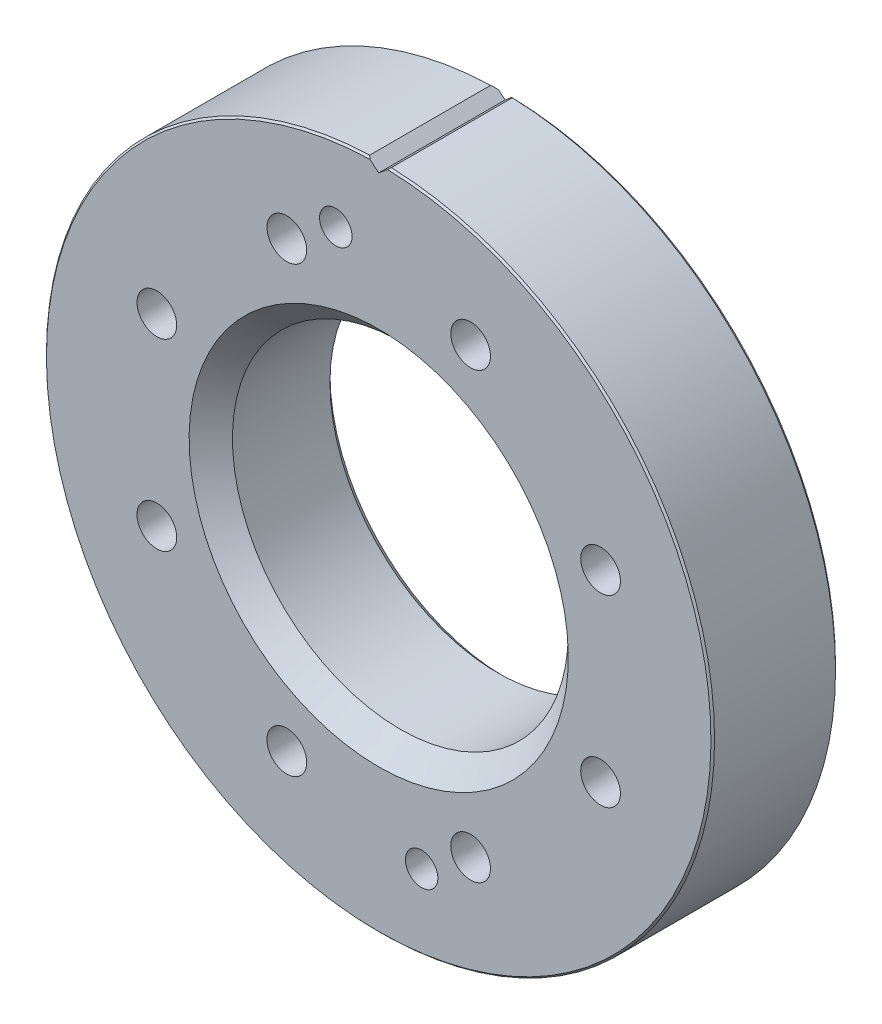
ISO-10303-21;
HEADER;
FILE_DESCRIPTION(('STEP AP214'),'2;1');
FILE_NAME('part.step','',(''),(''),'','','');
FILE_SCHEMA(('AUTOMOTIVE_DESIGN { 1 0 10303 214 1 1 1 1 }'));
ENDSEC;
DATA;
#1=APPLICATION_CONTEXT('core data for automotive mechanical design processes');
#2=APPLICATION_PROTOCOL_DEFINITION('international standard','automotive_design',2000,#1);
#3=PRODUCT_CONTEXT('',#1,'mechanical');
#4=PRODUCT('Part','Part','',(#3));
#5=PRODUCT_RELATED_PRODUCT_CATEGORY('part','',(#4));
#6=PRODUCT_DEFINITION_FORMATION('','',#4);
#7=PRODUCT_DEFINITION_CONTEXT('part definition',#1,'design');
#8=PRODUCT_DEFINITION('design','',#6,#7);
#9=PRODUCT_DEFINITION_SHAPE('','',#8);
#10=(LENGTH_UNIT() NAMED_UNIT(*) SI_UNIT(.MILLI.,.METRE.));
#11=(NAMED_UNIT(*) PLANE_ANGLE_UNIT() SI_UNIT($,.RADIAN.));
#12=(NAMED_UNIT(*) SI_UNIT($,.STERADIAN.) SOLID_ANGLE_UNIT());
#13=UNCERTAINTY_MEASURE_WITH_UNIT(LENGTH_MEASURE(1.E-05),#10,'distance_accuracy_value','');
#14=(GEOMETRIC_REPRESENTATION_CONTEXT(3) GLOBAL_UNCERTAINTY_ASSIGNED_CONTEXT((#13)) GLOBAL_UNIT_ASSIGNED_CONTEXT((#10,
#11,#12)) REPRESENTATION_CONTEXT('',''));
#15=CARTESIAN_POINT('',(0.,0.,0.));
#16=DIRECTION('',(0.,0.,1.));
#17=DIRECTION('',(1.,0.,0.));
#18=AXIS2_PLACEMENT_3D('',#15,#16,#17);
#19=CARTESIAN_POINT('',(0.,2048.00000000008,-2257.50000000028));
#20=DIRECTION('',(0.,0.,-1.));
#21=DIRECTION('',(-1.,0.,0.));
#22=AXIS2_PLACEMENT_3D('',#19,#20,#21);
#23=CONICAL_SURFACE('',#22,5.0000000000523,1.02974425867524);
#24=CARTESIAN_POINT('',(5.6843418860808E-11,2048.00000000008,-2254.49569690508));
#25=VERTEX_POINT('',#24);
#26=VERTEX_LOOP('',#25);
#27=FACE_BOUND('',#26,.T.);
#28=CARTESIAN_POINT('',(0.,2048.00000000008,-2257.50000000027));
#29=DIRECTION('',(0.,0.,-1.));
#30=DIRECTION('',(-1.,0.,0.));
#31=AXIS2_PLACEMENT_3D('',#28,#29,#30);
#32=CIRCLE('',#31,5.);
#33=CARTESIAN_POINT('',(-5.,2048.00000000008,-2257.50000000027));
#34=VERTEX_POINT('',#33);
#35=EDGE_CURVE('E502',#34,#34,#32,.T.);
#36=ORIENTED_EDGE('',*,*,#35,.T.);
#37=EDGE_LOOP('',(#36));
#38=FACE_BOUND('',#37,.T.);
#39=ADVANCED_FACE('F17',(#27,#38),#23,.F.);
#40=CARTESIAN_POINT('',(0.,2048.00000000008,-2277.50000000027));
#41=DIRECTION('',(0.,0.,-1.));
#42=DIRECTION('',(-1.,0.,0.));
#43=AXIS2_PLACEMENT_3D('',#40,#41,#42);
#44=CYLINDRICAL_SURFACE('',#43,5.);
#45=ORIENTED_EDGE('',*,*,#35,.F.);
#46=EDGE_LOOP('',(#45));
#47=FACE_BOUND('',#46,.T.);
#48=CARTESIAN_POINT('',(0.,2048.00000000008,-2277.00000000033));
#49=DIRECTION('',(0.,0.,-1.));
#50=DIRECTION('',(-1.,0.,0.));
#51=AXIS2_PLACEMENT_3D('',#48,#49,#50);
#52=CIRCLE('',#51,4.99999999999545);
#53=CARTESIAN_POINT('',(-4.99999999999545,2048.00000000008,-2277.00000000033));
#54=VERTEX_POINT('',#53);
#55=EDGE_CURVE('E505',#54,#54,#52,.T.);
#56=ORIENTED_EDGE('',*,*,#55,.T.);
#57=EDGE_LOOP('',(#56));
#58=FACE_BOUND('',#57,.T.);
#59=ADVANCED_FACE('F491',(#47,#58),#44,.F.);
#60=CARTESIAN_POINT('',(41.2499999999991,2061.4470958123,-2253.00000000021));
#61=DIRECTION('',(0.,0.,-1.));
#62=DIRECTION('',(-1.,0.,0.));
#63=AXIS2_PLACEMENT_3D('',#60,#61,#62);
#64=CONICAL_SURFACE('',#63,4.24999999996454,1.02974425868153);
#65=CARTESIAN_POINT('',(41.2499999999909,2061.4470958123,-2250.4463423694));
#66=VERTEX_POINT('',#65);
#67=VERTEX_LOOP('',#66);
#68=FACE_BOUND('',#67,.T.);
#69=CARTESIAN_POINT('',(41.2499999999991,2061.4470958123,-2253.00000000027));
#70=DIRECTION('',(0.,0.,-1.));
#71=DIRECTION('',(-1.,0.,0.));
#72=AXIS2_PLACEMENT_3D('',#69,#70,#71);
#73=CIRCLE('',#72,4.25);
#74=CARTESIAN_POINT('',(36.9999999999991,2061.4470958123,-2253.00000000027));
#75=VERTEX_POINT('',#74);
#76=EDGE_CURVE('E506',#75,#75,#73,.T.);
#77=ORIENTED_EDGE('',*,*,#76,.T.);
#78=EDGE_LOOP('',(#77));
#79=FACE_BOUND('',#78,.T.);
#80=ADVANCED_FACE('F488',(#68,#79),#64,.F.);
#81=CARTESIAN_POINT('',(71.4470958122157,2031.25000000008,-2253.00000000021));
#82=DIRECTION('',(0.,0.,-1.));
#83=DIRECTION('',(-1.,0.,0.));
#84=AXIS2_PLACEMENT_3D('',#81,#82,#83);
#85=CONICAL_SURFACE('',#84,4.24999999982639,1.0297442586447);
#86=CARTESIAN_POINT('',(71.4470958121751,2031.25000000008,-2250.44634236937));
#87=VERTEX_POINT('',#86);
#88=VERTEX_LOOP('',#87);
#89=FACE_BOUND('',#88,.T.);
#90=CARTESIAN_POINT('',(71.4470958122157,2031.25000000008,-2253.00000000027));
#91=DIRECTION('',(0.,0.,-1.));
#92=DIRECTION('',(-1.,0.,0.));
#93=AXIS2_PLACEMENT_3D('',#90,#91,#92);
#94=CIRCLE('',#93,4.25);
#95=CARTESIAN_POINT('',(67.1970958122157,2031.25000000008,-2253.00000000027));
#96=VERTEX_POINT('',#95);
#97=EDGE_CURVE('E509',#96,#96,#94,.T.);
#98=ORIENTED_EDGE('',*,*,#97,.T.);
#99=EDGE_LOOP('',(#98));
#100=FACE_BOUND('',#99,.T.);
#101=ADVANCED_FACE('F484',(#89,#100),#85,.F.);
#102=CARTESIAN_POINT('',(82.5,1990.00000000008,-2253.00000000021));
#103=DIRECTION('',(0.,0.,-1.));
#104=DIRECTION('',(-1.,0.,0.));
#105=AXIS2_PLACEMENT_3D('',#102,#103,#104);
#106=CONICAL_SURFACE('',#105,4.24999999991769,1.02974425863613);
#107=CARTESIAN_POINT('',(82.4999999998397,1990.00000000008,-2250.44634236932));
#108=VERTEX_POINT('',#107);
#109=VERTEX_LOOP('',#108);
#110=FACE_BOUND('',#109,.T.);
#111=CARTESIAN_POINT('',(82.5,1990.00000000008,-2253.00000000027));
#112=DIRECTION('',(0.,0.,-1.));
#113=DIRECTION('',(-1.,0.,0.));
#114=AXIS2_PLACEMENT_3D('',#111,#112,#113);
#115=CIRCLE('',#114,4.25);
#116=CARTESIAN_POINT('',(78.25,1990.00000000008,-2253.00000000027));
#117=VERTEX_POINT('',#116);
#118=EDGE_CURVE('E518',#117,#117,#115,.T.);
#119=ORIENTED_EDGE('',*,*,#118,.T.);
#120=EDGE_LOOP('',(#119));
#121=FACE_BOUND('',#120,.T.);
#122=ADVANCED_FACE('F480',(#110,#121),#106,.F.);
#123=CARTESIAN_POINT('',(71.4470958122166,1948.75000000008,-2253.00000000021));
#124=DIRECTION('',(0.,0.,-1.));
#125=DIRECTION('',(-1.,0.,0.));
#126=AXIS2_PLACEMENT_3D('',#123,#124,#125);
#127=CONICAL_SURFACE('',#126,4.24999999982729,1.02974425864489);
#128=CARTESIAN_POINT('',(71.4470958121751,1948.75000000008,-2250.44634236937));
#129=VERTEX_POINT('',#128);
#130=VERTEX_LOOP('',#129);
#131=FACE_BOUND('',#130,.T.);
#132=CARTESIAN_POINT('',(71.4470958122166,1948.75000000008,-2253.00000000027));
#133=DIRECTION('',(0.,0.,-1.));
#134=DIRECTION('',(-1.,0.,0.));
#135=AXIS2_PLACEMENT_3D('',#132,#133,#134);
#136=CIRCLE('',#135,4.25);
#137=CARTESIAN_POINT('',(67.1970958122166,1948.75000000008,-2253.00000000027));
#138=VERTEX_POINT('',#137);
#139=EDGE_CURVE('E521',#138,#138,#136,.T.);
#140=ORIENTED_EDGE('',*,*,#139,.T.);
#141=EDGE_LOOP('',(#140));
#142=FACE_BOUND('',#141,.T.);
#143=ADVANCED_FACE('F476',(#131,#142),#127,.F.);
#144=CARTESIAN_POINT('',(41.2500000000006,1918.55290418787,-2253.00000000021));
#145=DIRECTION('',(0.,0.,-1.));
#146=DIRECTION('',(-1.,0.,0.));
#147=AXIS2_PLACEMENT_3D('',#144,#145,#146);
#148=CONICAL_SURFACE('',#147,4.24999999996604,1.02974425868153);
#149=CARTESIAN_POINT('',(41.2499999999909,1918.55290418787,-2250.4463423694));
#150=VERTEX_POINT('',#149);
#151=VERTEX_LOOP('',#150);
#152=FACE_BOUND('',#151,.T.);
#153=CARTESIAN_POINT('',(41.2500000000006,1918.55290418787,-2253.00000000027));
#154=DIRECTION('',(0.,0.,-1.));
#155=DIRECTION('',(-1.,0.,0.));
#156=AXIS2_PLACEMENT_3D('',#153,#154,#155);
#157=CIRCLE('',#156,4.25);
#158=CARTESIAN_POINT('',(37.0000000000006,1918.55290418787,-2253.00000000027));
#159=VERTEX_POINT('',#158);
#160=EDGE_CURVE('E524',#159,#159,#157,.T.);
#161=ORIENTED_EDGE('',*,*,#160,.T.);
#162=EDGE_LOOP('',(#161));
#163=FACE_BOUND('',#162,.T.);
#164=ADVANCED_FACE('F472',(#152,#163),#148,.F.);
#165=CARTESIAN_POINT('',(0.,1907.50000000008,-2253.00000000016));
#166=DIRECTION('',(0.,0.,-1.));
#167=DIRECTION('',(-1.,0.,0.));
#168=AXIS2_PLACEMENT_3D('',#165,#166,#167);
#169=CONICAL_SURFACE('',#168,4.24999999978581,1.02974425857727);
#170=CARTESIAN_POINT('',(-1.98951966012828E-10,1907.50000000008,-2250.44634236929));
#171=VERTEX_POINT('',#170);
#172=VERTEX_LOOP('',#171);
#173=FACE_BOUND('',#172,.T.);
#174=CARTESIAN_POINT('',(0.,1907.50000000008,-2253.00000000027));
#175=DIRECTION('',(0.,0.,-1.));
#176=DIRECTION('',(-1.,0.,0.));
#177=AXIS2_PLACEMENT_3D('',#174,#175,#176);
#178=CIRCLE('',#177,4.25);
#179=CARTESIAN_POINT('',(-4.25,1907.50000000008,-2253.00000000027));
#180=VERTEX_POINT('',#179);
#181=EDGE_CURVE('E527',#180,#180,#178,.T.);
#182=ORIENTED_EDGE('',*,*,#181,.T.);
#183=EDGE_LOOP('',(#182));
#184=FACE_BOUND('',#183,.T.);
#185=ADVANCED_FACE('F468',(#173,#184),#169,.F.);
#186=CARTESIAN_POINT('',(-41.25,1918.55290418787,-2253.00000000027));
#187=DIRECTION('',(0.,0.,-1.));
#188=DIRECTION('',(-1.,0.,0.));
#189=AXIS2_PLACEMENT_3D('',#186,#187,#188);
#190=CONICAL_SURFACE('',#189,4.25000000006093,1.02974425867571);
#191=CARTESIAN_POINT('',(-41.2500000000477,1918.55290418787,-2250.44634236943));
#192=VERTEX_POINT('',#191);
#193=VERTEX_LOOP('',#192);
#194=FACE_BOUND('',#193,.T.);
#195=CARTESIAN_POINT('',(-41.25,1918.55290418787,-2253.00000000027));
#196=DIRECTION('',(0.,0.,-1.));
#197=DIRECTION('',(-1.,0.,0.));
#198=AXIS2_PLACEMENT_3D('',#195,#196,#197);
#199=CIRCLE('',#198,4.25);
#200=CARTESIAN_POINT('',(-45.5,1918.55290418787,-2253.00000000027));
#201=VERTEX_POINT('',#200);
#202=EDGE_CURVE('E530',#201,#201,#199,.T.);
#203=ORIENTED_EDGE('',*,*,#202,.T.);
#204=EDGE_LOOP('',(#203));
#205=FACE_BOUND('',#204,.T.);
#206=ADVANCED_FACE('F464',(#194,#205),#190,.F.);
#207=CARTESIAN_POINT('',(-71.447095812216,1948.75000000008,-2253.00000000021));
#208=DIRECTION('',(0.,0.,-1.));
#209=DIRECTION('',(-1.,0.,0.));
#210=AXIS2_PLACEMENT_3D('',#207,#208,#209);
#211=CONICAL_SURFACE('',#210,4.2499999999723,1.02974425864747);
#212=CARTESIAN_POINT('',(-71.4470958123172,1948.75000000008,-2250.44634236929));
#213=VERTEX_POINT('',#212);
#214=VERTEX_LOOP('',#213);
#215=FACE_BOUND('',#214,.T.);
#216=CARTESIAN_POINT('',(-71.447095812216,1948.75000000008,-2253.00000000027));
#217=DIRECTION('',(0.,0.,-1.));
#218=DIRECTION('',(-1.,0.,0.));
#219=AXIS2_PLACEMENT_3D('',#216,#217,#218);
#220=CIRCLE('',#219,4.25);
#221=CARTESIAN_POINT('',(-75.697095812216,1948.75000000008,-2253.00000000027));
#222=VERTEX_POINT('',#221);
#223=EDGE_CURVE('E533',#222,#222,#220,.T.);
#224=ORIENTED_EDGE('',*,*,#223,.T.);
#225=EDGE_LOOP('',(#224));
#226=FACE_BOUND('',#225,.T.);
#227=ADVANCED_FACE('F460',(#215,#226),#211,.F.);
#228=CARTESIAN_POINT('',(-82.5,1990.00000000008,-2253.00000000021));
#229=DIRECTION('',(0.,0.,-1.));
#230=DIRECTION('',(-1.,0.,0.));
#231=AXIS2_PLACEMENT_3D('',#228,#229,#230);
#232=CONICAL_SURFACE('',#231,4.24999999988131,1.02974425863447);
#233=CARTESIAN_POINT('',(-82.5000000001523,1990.00000000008,-2250.44634236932));
#234=VERTEX_POINT('',#233);
#235=VERTEX_LOOP('',#234);
#236=FACE_BOUND('',#235,.T.);
#237=CARTESIAN_POINT('',(-82.5,1990.00000000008,-2253.00000000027));
#238=DIRECTION('',(0.,0.,-1.));
#239=DIRECTION('',(-1.,0.,0.));
#240=AXIS2_PLACEMENT_3D('',#237,#238,#239);
#241=CIRCLE('',#240,4.25);
#242=CARTESIAN_POINT('',(-86.75,1990.00000000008,-2253.00000000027));
#243=VERTEX_POINT('',#242);
#244=EDGE_CURVE('E536',#243,#243,#241,.T.);
#245=ORIENTED_EDGE('',*,*,#244,.T.);
#246=EDGE_LOOP('',(#245));
#247=FACE_BOUND('',#246,.T.);
#248=ADVANCED_FACE('F456',(#236,#247),#232,.F.);
#249=CARTESIAN_POINT('',(-71.4470958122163,2031.25000000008,-2253.00000000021));
#250=DIRECTION('',(0.,0.,-1.));
#251=DIRECTION('',(-1.,0.,0.));
#252=AXIS2_PLACEMENT_3D('',#249,#250,#251);
#253=CONICAL_SURFACE('',#252,4.24999999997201,1.02974425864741);
#254=CARTESIAN_POINT('',(-71.4470958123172,2031.25000000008,-2250.44634236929));
#255=VERTEX_POINT('',#254);
#256=VERTEX_LOOP('',#255);
#257=FACE_BOUND('',#256,.T.);
#258=CARTESIAN_POINT('',(-71.4470958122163,2031.25000000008,-2253.00000000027));
#259=DIRECTION('',(0.,0.,-1.));
#260=DIRECTION('',(-1.,0.,0.));
#261=AXIS2_PLACEMENT_3D('',#258,#259,#260);
#262=CIRCLE('',#261,4.25);
#263=CARTESIAN_POINT('',(-75.6970958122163,2031.25000000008,-2253.00000000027));
#264=VERTEX_POINT('',#263);
#265=EDGE_CURVE('E539',#264,#264,#262,.T.);
#266=ORIENTED_EDGE('',*,*,#265,.T.);
#267=EDGE_LOOP('',(#266));
#268=FACE_BOUND('',#267,.T.);
#269=ADVANCED_FACE('F452',(#257,#268),#253,.F.);
#270=CARTESIAN_POINT('',(-41.25,2061.4470958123,-2253.00000000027));
#271=DIRECTION('',(0.,0.,-1.));
#272=DIRECTION('',(-1.,0.,0.));
#273=AXIS2_PLACEMENT_3D('',#270,#271,#272);
#274=CONICAL_SURFACE('',#273,4.25000000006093,1.02974425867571);
#275=CARTESIAN_POINT('',(-41.2500000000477,2061.4470958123,-2250.44634236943));
#276=VERTEX_POINT('',#275);
#277=VERTEX_LOOP('',#276);
#278=FACE_BOUND('',#277,.T.);
#279=CARTESIAN_POINT('',(-41.25,2061.4470958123,-2253.00000000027));
#280=DIRECTION('',(0.,0.,-1.));
#281=DIRECTION('',(-1.,0.,0.));
#282=AXIS2_PLACEMENT_3D('',#279,#280,#281);
#283=CIRCLE('',#282,4.25);
#284=CARTESIAN_POINT('',(-45.5,2061.4470958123,-2253.00000000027));
#285=VERTEX_POINT('',#284);
#286=EDGE_CURVE('E542',#285,#285,#283,.T.);
#287=ORIENTED_EDGE('',*,*,#286,.T.);
#288=EDGE_LOOP('',(#287));
#289=FACE_BOUND('',#288,.T.);
#290=ADVANCED_FACE('F448',(#278,#289),#274,.F.);
#291=CARTESIAN_POINT('',(0.,2072.50000000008,-2253.00000000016));
#292=DIRECTION('',(0.,0.,-1.));
#293=DIRECTION('',(-1.,0.,0.));
#294=AXIS2_PLACEMENT_3D('',#291,#292,#293);
#295=CONICAL_SURFACE('',#294,4.24999999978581,1.02974425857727);
#296=CARTESIAN_POINT('',(-1.98951966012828E-10,2072.50000000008,-2250.44634236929));
#297=VERTEX_POINT('',#296);
#298=VERTEX_LOOP('',#297);
#299=FACE_BOUND('',#298,.T.);
#300=CARTESIAN_POINT('',(0.,2072.50000000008,-2253.00000000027));
#301=DIRECTION('',(0.,0.,-1.));
#302=DIRECTION('',(-1.,0.,0.));
#303=AXIS2_PLACEMENT_3D('',#300,#301,#302);
#304=CIRCLE('',#303,4.25);
#305=CARTESIAN_POINT('',(-4.25,2072.50000000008,-2253.00000000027));
#306=VERTEX_POINT('',#305);
#307=EDGE_CURVE('E545',#306,#306,#304,.T.);
#308=ORIENTED_EDGE('',*,*,#307,.T.);
#309=EDGE_LOOP('',(#308));
#310=FACE_BOUND('',#309,.T.);
#311=ADVANCED_FACE('F444',(#299,#310),#295,.F.);
#312=CARTESIAN_POINT('',(0.,2048.00000000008,-2277.50000000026));
#313=DIRECTION('',(0.,0.,-1.));
#314=DIRECTION('',(-1.,0.,0.));
#315=AXIS2_PLACEMENT_3D('',#312,#313,#314);
#316=CONICAL_SURFACE('',#315,5.49999999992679,0.785398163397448);
#317=ORIENTED_EDGE('',*,*,#55,.F.);
#318=EDGE_LOOP('',(#317));
#319=FACE_BOUND('',#318,.T.);
#320=CARTESIAN_POINT('',(0.,2048.00000000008,-2277.50000000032));
#321=DIRECTION('',(0.,0.,-1.));
#322=DIRECTION('',(-1.,0.,0.));
#323=AXIS2_PLACEMENT_3D('',#320,#321,#322);
#324=CIRCLE('',#323,5.49999999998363);
#325=CARTESIAN_POINT('',(-5.49999999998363,2048.00000000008,-2277.50000000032));
#326=VERTEX_POINT('',#325);
#327=EDGE_CURVE('E551',#326,#326,#324,.T.);
#328=ORIENTED_EDGE('',*,*,#327,.T.);
#329=EDGE_LOOP('',(#328));
#330=FACE_BOUND('',#329,.T.);
#331=ADVANCED_FACE('F440',(#319,#330),#316,.F.);
#332=CARTESIAN_POINT('',(41.2499999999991,2061.4470958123,-2277.50000000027));
#333=DIRECTION('',(0.,0.,-1.));
#334=DIRECTION('',(-1.,0.,0.));
#335=AXIS2_PLACEMENT_3D('',#332,#333,#334);
#336=CYLINDRICAL_SURFACE('',#335,4.25);
#337=ORIENTED_EDGE('',*,*,#76,.F.);
#338=EDGE_LOOP('',(#337));
#339=FACE_BOUND('',#338,.T.);
#340=CARTESIAN_POINT('',(41.2499999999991,2061.4470958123,-2277.50000000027));
#341=DIRECTION('',(0.,0.,-1.));
#342=DIRECTION('',(-1.,0.,0.));
#343=AXIS2_PLACEMENT_3D('',#340,#341,#342);
#344=CIRCLE('',#343,4.25);
#345=CARTESIAN_POINT('',(36.9999999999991,2061.4470958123,-2277.50000000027));
#346=VERTEX_POINT('',#345);
#347=EDGE_CURVE('E654',#346,#346,#344,.T.);
#348=ORIENTED_EDGE('',*,*,#347,.T.);
#349=EDGE_LOOP('',(#348));
#350=FACE_BOUND('',#349,.T.);
#351=ADVANCED_FACE('F436',(#339,#350),#336,.F.);
#352=CARTESIAN_POINT('',(71.4470958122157,2031.25000000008,-2277.50000000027));
#353=DIRECTION('',(0.,0.,-1.));
#354=DIRECTION('',(-1.,0.,0.));
#355=AXIS2_PLACEMENT_3D('',#352,#353,#354);
#356=CYLINDRICAL_SURFACE('',#355,4.25);
#357=ORIENTED_EDGE('',*,*,#97,.F.);
#358=EDGE_LOOP('',(#357));
#359=FACE_BOUND('',#358,.T.);
#360=CARTESIAN_POINT('',(71.4470958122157,2031.25000000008,-2277.50000000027));
#361=DIRECTION('',(0.,0.,-1.));
#362=DIRECTION('',(-1.,0.,0.));
#363=AXIS2_PLACEMENT_3D('',#360,#361,#362);
#364=CIRCLE('',#363,4.25);
#365=CARTESIAN_POINT('',(67.1970958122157,2031.25000000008,-2277.50000000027));
#366=VERTEX_POINT('',#365);
#367=EDGE_CURVE('E651',#366,#366,#364,.T.);
#368=ORIENTED_EDGE('',*,*,#367,.T.);
#369=EDGE_LOOP('',(#368));
#370=FACE_BOUND('',#369,.T.);
#371=ADVANCED_FACE('F432',(#359,#370),#356,.F.);
#372=CARTESIAN_POINT('',(82.5,1990.00000000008,-2277.50000000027));
#373=DIRECTION('',(0.,0.,-1.));
#374=DIRECTION('',(-1.,0.,0.));
#375=AXIS2_PLACEMENT_3D('',#372,#373,#374);
#376=CYLINDRICAL_SURFACE('',#375,4.25);
#377=ORIENTED_EDGE('',*,*,#118,.F.);
#378=EDGE_LOOP('',(#377));
#379=FACE_BOUND('',#378,.T.);
#380=CARTESIAN_POINT('',(82.5,1990.00000000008,-2277.50000000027));
#381=DIRECTION('',(0.,0.,-1.));
#382=DIRECTION('',(-1.,0.,0.));
#383=AXIS2_PLACEMENT_3D('',#380,#381,#382);
#384=CIRCLE('',#383,4.25);
#385=CARTESIAN_POINT('',(78.25,1990.00000000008,-2277.50000000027));
#386=VERTEX_POINT('',#385);
#387=EDGE_CURVE('E648',#386,#386,#384,.T.);
#388=ORIENTED_EDGE('',*,*,#387,.T.);
#389=EDGE_LOOP('',(#388));
#390=FACE_BOUND('',#389,.T.);
#391=ADVANCED_FACE('F428',(#379,#390),#376,.F.);
#392=CARTESIAN_POINT('',(71.4470958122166,1948.75000000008,-2277.50000000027));
#393=DIRECTION('',(0.,0.,-1.));
#394=DIRECTION('',(-1.,0.,0.));
#395=AXIS2_PLACEMENT_3D('',#392,#393,#394);
#396=CYLINDRICAL_SURFACE('',#395,4.25);
#397=ORIENTED_EDGE('',*,*,#139,.F.);
#398=EDGE_LOOP('',(#397));
#399=FACE_BOUND('',#398,.T.);
#400=CARTESIAN_POINT('',(71.4470958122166,1948.75000000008,-2277.50000000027));
#401=DIRECTION('',(0.,0.,-1.));
#402=DIRECTION('',(-1.,0.,0.));
#403=AXIS2_PLACEMENT_3D('',#400,#401,#402);
#404=CIRCLE('',#403,4.25);
#405=CARTESIAN_POINT('',(67.1970958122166,1948.75000000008,-2277.50000000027));
#406=VERTEX_POINT('',#405);
#407=EDGE_CURVE('E645',#406,#406,#404,.T.);
#408=ORIENTED_EDGE('',*,*,#407,.T.);
#409=EDGE_LOOP('',(#408));
#410=FACE_BOUND('',#409,.T.);
#411=ADVANCED_FACE('F424',(#399,#410),#396,.F.);
#412=CARTESIAN_POINT('',(41.2500000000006,1918.55290418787,-2277.50000000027));
#413=DIRECTION('',(0.,0.,-1.));
#414=DIRECTION('',(-1.,0.,0.));
#415=AXIS2_PLACEMENT_3D('',#412,#413,#414);
#416=CYLINDRICAL_SURFACE('',#415,4.25);
#417=ORIENTED_EDGE('',*,*,#160,.F.);
#418=EDGE_LOOP('',(#417));
#419=FACE_BOUND('',#418,.T.);
#420=CARTESIAN_POINT('',(41.2500000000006,1918.55290418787,-2277.50000000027));
#421=DIRECTION('',(0.,0.,-1.));
#422=DIRECTION('',(-1.,0.,0.));
#423=AXIS2_PLACEMENT_3D('',#420,#421,#422);
#424=CIRCLE('',#423,4.25);
#425=CARTESIAN_POINT('',(37.0000000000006,1918.55290418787,-2277.50000000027));
#426=VERTEX_POINT('',#425);
#427=EDGE_CURVE('E642',#426,#426,#424,.T.);
#428=ORIENTED_EDGE('',*,*,#427,.T.);
#429=EDGE_LOOP('',(#428));
#430=FACE_BOUND('',#429,.T.);
#431=ADVANCED_FACE('F420',(#419,#430),#416,.F.);
#432=CARTESIAN_POINT('',(0.,1907.50000000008,-2277.50000000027));
#433=DIRECTION('',(0.,0.,-1.));
#434=DIRECTION('',(-1.,0.,0.));
#435=AXIS2_PLACEMENT_3D('',#432,#433,#434);
#436=CYLINDRICAL_SURFACE('',#435,4.25);
#437=ORIENTED_EDGE('',*,*,#181,.F.);
#438=EDGE_LOOP('',(#437));
#439=FACE_BOUND('',#438,.T.);
#440=CARTESIAN_POINT('',(0.,1907.50000000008,-2277.50000000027));
#441=DIRECTION('',(0.,0.,-1.));
#442=DIRECTION('',(-1.,0.,0.));
#443=AXIS2_PLACEMENT_3D('',#440,#441,#442);
#444=CIRCLE('',#443,4.25);
#445=CARTESIAN_POINT('',(-4.25,1907.50000000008,-2277.50000000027));
#446=VERTEX_POINT('',#445);
#447=EDGE_CURVE('E639',#446,#446,#444,.T.);
#448=ORIENTED_EDGE('',*,*,#447,.T.);
#449=EDGE_LOOP('',(#448));
#450=FACE_BOUND('',#449,.T.);
#451=ADVANCED_FACE('F416',(#439,#450),#436,.F.);
#452=CARTESIAN_POINT('',(-41.25,1918.55290418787,-2277.50000000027));
#453=DIRECTION('',(0.,0.,-1.));
#454=DIRECTION('',(-1.,0.,0.));
#455=AXIS2_PLACEMENT_3D('',#452,#453,#454);
#456=CYLINDRICAL_SURFACE('',#455,4.25);
#457=ORIENTED_EDGE('',*,*,#202,.F.);
#458=EDGE_LOOP('',(#457));
#459=FACE_BOUND('',#458,.T.);
#460=CARTESIAN_POINT('',(-41.25,1918.55290418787,-2277.50000000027));
#461=DIRECTION('',(0.,0.,-1.));
#462=DIRECTION('',(-1.,0.,0.));
#463=AXIS2_PLACEMENT_3D('',#460,#461,#462);
#464=CIRCLE('',#463,4.25);
#465=CARTESIAN_POINT('',(-45.5,1918.55290418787,-2277.50000000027));
#466=VERTEX_POINT('',#465);
#467=EDGE_CURVE('E636',#466,#466,#464,.T.);
#468=ORIENTED_EDGE('',*,*,#467,.T.);
#469=EDGE_LOOP('',(#468));
#470=FACE_BOUND('',#469,.T.);
#471=ADVANCED_FACE('F412',(#459,#470),#456,.F.);
#472=CARTESIAN_POINT('',(-71.447095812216,1948.75000000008,-2277.50000000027));
#473=DIRECTION('',(0.,0.,-1.));
#474=DIRECTION('',(-1.,0.,0.));
#475=AXIS2_PLACEMENT_3D('',#472,#473,#474);
#476=CYLINDRICAL_SURFACE('',#475,4.25);
#477=ORIENTED_EDGE('',*,*,#223,.F.);
#478=EDGE_LOOP('',(#477));
#479=FACE_BOUND('',#478,.T.);
#480=CARTESIAN_POINT('',(-71.447095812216,1948.75000000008,-2277.50000000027));
#481=DIRECTION('',(0.,0.,-1.));
#482=DIRECTION('',(-1.,0.,0.));
#483=AXIS2_PLACEMENT_3D('',#480,#481,#482);
#484=CIRCLE('',#483,4.25);
#485=CARTESIAN_POINT('',(-75.697095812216,1948.75000000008,-2277.50000000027));
#486=VERTEX_POINT('',#485);
#487=EDGE_CURVE('E633',#486,#486,#484,.T.);
#488=ORIENTED_EDGE('',*,*,#487,.T.);
#489=EDGE_LOOP('',(#488));
#490=FACE_BOUND('',#489,.T.);
#491=ADVANCED_FACE('F408',(#479,#490),#476,.F.);
#492=CARTESIAN_POINT('',(-82.5,1990.00000000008,-2277.50000000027));
#493=DIRECTION('',(0.,0.,-1.));
#494=DIRECTION('',(-1.,0.,0.));
#495=AXIS2_PLACEMENT_3D('',#492,#493,#494);
#496=CYLINDRICAL_SURFACE('',#495,4.25);
#497=ORIENTED_EDGE('',*,*,#244,.F.);
#498=EDGE_LOOP('',(#497));
#499=FACE_BOUND('',#498,.T.);
#500=CARTESIAN_POINT('',(-82.5,1990.00000000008,-2277.50000000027));
#501=DIRECTION('',(0.,0.,-1.));
#502=DIRECTION('',(-1.,0.,0.));
#503=AXIS2_PLACEMENT_3D('',#500,#501,#502);
#504=CIRCLE('',#503,4.25);
#505=CARTESIAN_POINT('',(-86.75,1990.00000000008,-2277.50000000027));
#506=VERTEX_POINT('',#505);
#507=EDGE_CURVE('E630',#506,#506,#504,.T.);
#508=ORIENTED_EDGE('',*,*,#507,.T.);
#509=EDGE_LOOP('',(#508));
#510=FACE_BOUND('',#509,.T.);
#511=ADVANCED_FACE('F404',(#499,#510),#496,.F.);
#512=CARTESIAN_POINT('',(-71.4470958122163,2031.25000000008,-2277.50000000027));
#513=DIRECTION('',(0.,0.,-1.));
#514=DIRECTION('',(-1.,0.,0.));
#515=AXIS2_PLACEMENT_3D('',#512,#513,#514);
#516=CYLINDRICAL_SURFACE('',#515,4.25);
#517=ORIENTED_EDGE('',*,*,#265,.F.);
#518=EDGE_LOOP('',(#517));
#519=FACE_BOUND('',#518,.T.);
#520=CARTESIAN_POINT('',(-71.4470958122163,2031.25000000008,-2277.50000000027));
#521=DIRECTION('',(0.,0.,-1.));
#522=DIRECTION('',(-1.,0.,0.));
#523=AXIS2_PLACEMENT_3D('',#520,#521,#522);
#524=CIRCLE('',#523,4.25);
#525=CARTESIAN_POINT('',(-75.6970958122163,2031.25000000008,-2277.50000000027));
#526=VERTEX_POINT('',#525);
#527=EDGE_CURVE('E627',#526,#526,#524,.T.);
#528=ORIENTED_EDGE('',*,*,#527,.T.);
#529=EDGE_LOOP('',(#528));
#530=FACE_BOUND('',#529,.T.);
#531=ADVANCED_FACE('F400',(#519,#530),#516,.F.);
#532=CARTESIAN_POINT('',(-41.25,2061.4470958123,-2277.50000000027));
#533=DIRECTION('',(0.,0.,-1.));
#534=DIRECTION('',(-1.,0.,0.));
#535=AXIS2_PLACEMENT_3D('',#532,#533,#534);
#536=CYLINDRICAL_SURFACE('',#535,4.25);
#537=ORIENTED_EDGE('',*,*,#286,.F.);
#538=EDGE_LOOP('',(#537));
#539=FACE_BOUND('',#538,.T.);
#540=CARTESIAN_POINT('',(-41.25,2061.4470958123,-2277.50000000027));
#541=DIRECTION('',(0.,0.,-1.));
#542=DIRECTION('',(-1.,0.,0.));
#543=AXIS2_PLACEMENT_3D('',#540,#541,#542);
#544=CIRCLE('',#543,4.25);
#545=CARTESIAN_POINT('',(-45.5,2061.4470958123,-2277.50000000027));
#546=VERTEX_POINT('',#545);
#547=EDGE_CURVE('E624',#546,#546,#544,.T.);
#548=ORIENTED_EDGE('',*,*,#547,.T.);
#549=EDGE_LOOP('',(#548));
#550=FACE_BOUND('',#549,.T.);
#551=ADVANCED_FACE('F396',(#539,#550),#536,.F.);
#552=CARTESIAN_POINT('',(0.,2072.50000000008,-2277.50000000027));
#553=DIRECTION('',(0.,0.,-1.));
#554=DIRECTION('',(-1.,0.,0.));
#555=AXIS2_PLACEMENT_3D('',#552,#553,#554);
#556=CYLINDRICAL_SURFACE('',#555,4.25);
#557=ORIENTED_EDGE('',*,*,#307,.F.);
#558=EDGE_LOOP('',(#557));
#559=FACE_BOUND('',#558,.T.);
#560=CARTESIAN_POINT('',(0.,2072.50000000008,-2277.50000000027));
#561=DIRECTION('',(0.,0.,-1.));
#562=DIRECTION('',(-1.,0.,0.));
#563=AXIS2_PLACEMENT_3D('',#560,#561,#562);
#564=CIRCLE('',#563,4.25);
#565=CARTESIAN_POINT('',(-4.25,2072.50000000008,-2277.50000000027));
#566=VERTEX_POINT('',#565);
#567=EDGE_CURVE('E621',#566,#566,#564,.T.);
#568=ORIENTED_EDGE('',*,*,#567,.T.);
#569=EDGE_LOOP('',(#568));
#570=FACE_BOUND('',#569,.T.);
#571=ADVANCED_FACE('F392',(#559,#570),#556,.F.);
#572=CARTESIAN_POINT('',(0.,1990.00000000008,-2277.50000000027));
#573=DIRECTION('',(0.,0.,-1.));
#574=DIRECTION('',(-1.,0.,0.));
#575=AXIS2_PLACEMENT_3D('',#572,#573,#574);
#576=CONICAL_SURFACE('',#575,48.5,0.785398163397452);
#577=CARTESIAN_POINT('',(0.,1990.00000000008,-2277.50000000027));
#578=DIRECTION('',(0.,0.,-1.));
#579=DIRECTION('',(-1.,0.,0.));
#580=AXIS2_PLACEMENT_3D('',#577,#578,#579);
#581=CIRCLE('',#580,48.5);
#582=CARTESIAN_POINT('',(-48.5,1990.00000000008,-2277.50000000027));
#583=VERTEX_POINT('',#582);
#584=EDGE_CURVE('E618',#583,#583,#581,.T.);
#585=ORIENTED_EDGE('',*,*,#584,.T.);
#586=EDGE_LOOP('',(#585));
#587=FACE_BOUND('',#586,.T.);
#588=CARTESIAN_POINT('',(0.,1990.00000000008,-2275.50000000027));
#589=DIRECTION('',(0.,0.,1.));
#590=DIRECTION('',(1.,0.,0.));
#591=AXIS2_PLACEMENT_3D('',#588,#589,#590);
#592=CIRCLE('',#591,46.5);
#593=CARTESIAN_POINT('',(46.5,1990.00000000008,-2275.50000000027));
#594=VERTEX_POINT('',#593);
#595=EDGE_CURVE('E548',#594,#594,#592,.T.);
#596=ORIENTED_EDGE('',*,*,#595,.T.);
#597=EDGE_LOOP('',(#596));
#598=FACE_BOUND('',#597,.T.);
#599=ADVANCED_FACE('F388',(#587,#598),#576,.F.);
#600=CARTESIAN_POINT('',(-61.4379889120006,1964.5515517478,-2277.50000000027));
#601=DIRECTION('',(0.,0.,-1.));
#602=DIRECTION('',(-1.,0.,0.));
#603=AXIS2_PLACEMENT_3D('',#600,#601,#602);
#604=CYLINDRICAL_SURFACE('',#603,8.99999999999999);
#605=CARTESIAN_POINT('',(-61.4379889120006,1964.5515517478,-2263.50000000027));
#606=DIRECTION('',(0.,0.,-1.));
#607=DIRECTION('',(-1.,0.,0.));
#608=AXIS2_PLACEMENT_3D('',#605,#606,#607);
#609=CIRCLE('',#608,8.99999999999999);
#610=CARTESIAN_POINT('',(-70.4379889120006,1964.5515517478,-2263.50000000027));
#611=VERTEX_POINT('',#610);
#612=EDGE_CURVE('E669',#611,#611,#609,.F.);
#613=ORIENTED_EDGE('',*,*,#612,.T.);
#614=EDGE_LOOP('',(#613));
#615=FACE_BOUND('',#614,.T.);
#616=CARTESIAN_POINT('',(-61.4379889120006,1964.5515517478,-2277.50000000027));
#617=DIRECTION('',(0.,0.,-1.));
#618=DIRECTION('',(-1.,0.,0.));
#619=AXIS2_PLACEMENT_3D('',#616,#617,#618);
#620=CIRCLE('',#619,8.99999999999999);
#621=CARTESIAN_POINT('',(-70.4379889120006,1964.5515517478,-2277.50000000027));
#622=VERTEX_POINT('',#621);
#623=EDGE_CURVE('E612',#622,#622,#620,.T.);
#624=ORIENTED_EDGE('',*,*,#623,.T.);
#625=EDGE_LOOP('',(#624));
#626=FACE_BOUND('',#625,.T.);
#627=ADVANCED_FACE('F384',(#615,#626),#604,.F.);
#628=CARTESIAN_POINT('',(25.4484482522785,1928.56201108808,-2277.50000000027));
#629=DIRECTION('',(0.,0.,-1.));
#630=DIRECTION('',(-1.,0.,0.));
#631=AXIS2_PLACEMENT_3D('',#628,#629,#630);
#632=CYLINDRICAL_SURFACE('',#631,9.);
#633=CARTESIAN_POINT('',(25.4484482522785,1928.56201108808,-2263.50000000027));
#634=DIRECTION('',(0.,0.,-1.));
#635=DIRECTION('',(-1.,0.,0.));
#636=AXIS2_PLACEMENT_3D('',#633,#634,#635);
#637=CIRCLE('',#636,9.);
#638=CARTESIAN_POINT('',(16.4484482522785,1928.56201108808,-2263.50000000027));
#639=VERTEX_POINT('',#638);
#640=EDGE_CURVE('E667',#639,#639,#637,.F.);
#641=ORIENTED_EDGE('',*,*,#640,.T.);
#642=EDGE_LOOP('',(#641));
#643=FACE_BOUND('',#642,.T.);
#644=CARTESIAN_POINT('',(25.4484482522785,1928.56201108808,-2277.50000000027));
#645=DIRECTION('',(0.,0.,-1.));
#646=DIRECTION('',(-1.,0.,0.));
#647=AXIS2_PLACEMENT_3D('',#644,#645,#646);
#648=CIRCLE('',#647,9.);
#649=CARTESIAN_POINT('',(16.4484482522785,1928.56201108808,-2277.50000000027));
#650=VERTEX_POINT('',#649);
#651=EDGE_CURVE('E606',#650,#650,#648,.T.);
#652=ORIENTED_EDGE('',*,*,#651,.T.);
#653=EDGE_LOOP('',(#652));
#654=FACE_BOUND('',#653,.T.);
#655=ADVANCED_FACE('F380',(#643,#654),#632,.F.);
#656=CARTESIAN_POINT('',(61.4379889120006,2015.44844825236,-2277.50000000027));
#657=DIRECTION('',(0.,0.,-1.));
#658=DIRECTION('',(-1.,0.,0.));
#659=AXIS2_PLACEMENT_3D('',#656,#657,#658);
#660=CYLINDRICAL_SURFACE('',#659,9.);
#661=CARTESIAN_POINT('',(61.4379889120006,2015.44844825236,-2263.50000000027));
#662=DIRECTION('',(0.,0.,-1.));
#663=DIRECTION('',(-1.,0.,0.));
#664=AXIS2_PLACEMENT_3D('',#661,#662,#663);
#665=CIRCLE('',#664,9.);
#666=CARTESIAN_POINT('',(52.4379889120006,2015.44844825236,-2263.50000000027));
#667=VERTEX_POINT('',#666);
#668=EDGE_CURVE('E664',#667,#667,#665,.F.);
#669=ORIENTED_EDGE('',*,*,#668,.T.);
#670=EDGE_LOOP('',(#669));
#671=FACE_BOUND('',#670,.T.);
#672=CARTESIAN_POINT('',(61.4379889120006,2015.44844825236,-2277.50000000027));
#673=DIRECTION('',(0.,0.,-1.));
#674=DIRECTION('',(-1.,0.,0.));
#675=AXIS2_PLACEMENT_3D('',#672,#673,#674);
#676=CIRCLE('',#675,9.);
#677=CARTESIAN_POINT('',(52.4379889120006,2015.44844825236,-2277.50000000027));
#678=VERTEX_POINT('',#677);
#679=EDGE_CURVE('E600',#678,#678,#676,.T.);
#680=ORIENTED_EDGE('',*,*,#679,.T.);
#681=EDGE_LOOP('',(#680));
#682=FACE_BOUND('',#681,.T.);
#683=ADVANCED_FACE('F376',(#671,#682),#660,.F.);
#684=CARTESIAN_POINT('',(-25.4484482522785,2051.43798891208,-2277.50000000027));
#685=DIRECTION('',(0.,0.,-1.));
#686=DIRECTION('',(-1.,0.,0.));
#687=AXIS2_PLACEMENT_3D('',#684,#685,#686);
#688=CYLINDRICAL_SURFACE('',#687,9.);
#689=CARTESIAN_POINT('',(-25.4484482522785,2051.43798891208,-2263.50000000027));
#690=DIRECTION('',(0.,0.,-1.));
#691=DIRECTION('',(-1.,0.,0.));
#692=AXIS2_PLACEMENT_3D('',#689,#690,#691);
#693=CIRCLE('',#692,9.);
#694=CARTESIAN_POINT('',(-34.4484482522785,2051.43798891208,-2263.50000000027));
#695=VERTEX_POINT('',#694);
#696=EDGE_CURVE('E552',#695,#695,#693,.F.);
#697=ORIENTED_EDGE('',*,*,#696,.T.);
#698=EDGE_LOOP('',(#697));
#699=FACE_BOUND('',#698,.T.);
#700=CARTESIAN_POINT('',(-25.4484482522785,2051.43798891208,-2277.50000000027));
#701=DIRECTION('',(0.,0.,-1.));
#702=DIRECTION('',(-1.,0.,0.));
#703=AXIS2_PLACEMENT_3D('',#700,#701,#702);
#704=CIRCLE('',#703,9.);
#705=CARTESIAN_POINT('',(-34.4484482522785,2051.43798891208,-2277.50000000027));
#706=VERTEX_POINT('',#705);
#707=EDGE_CURVE('E594',#706,#706,#704,.T.);
#708=ORIENTED_EDGE('',*,*,#707,.T.);
#709=EDGE_LOOP('',(#708));
#710=FACE_BOUND('',#709,.T.);
#711=ADVANCED_FACE('F372',(#699,#710),#688,.F.);
#712=CARTESIAN_POINT('',(-11.8834276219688,2061.01256331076,-2277.50000000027));
#713=DIRECTION('',(0.,0.,-1.));
#714=DIRECTION('',(-1.,0.,0.));
#715=AXIS2_PLACEMENT_3D('',#712,#713,#714);
#716=CYLINDRICAL_SURFACE('',#715,7.5);
#717=CARTESIAN_POINT('',(-11.8834276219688,2061.01256331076,-2267.50000000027));
#718=DIRECTION('',(0.,0.,-1.));
#719=DIRECTION('',(-1.,0.,0.));
#720=AXIS2_PLACEMENT_3D('',#717,#718,#719);
#721=CIRCLE('',#720,7.5);
#722=CARTESIAN_POINT('',(-19.3834276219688,2061.01256331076,-2267.50000000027));
#723=VERTEX_POINT('',#722);
#724=EDGE_CURVE('E20',#723,#723,#721,.F.);
#725=ORIENTED_EDGE('',*,*,#724,.T.);
#726=EDGE_LOOP('',(#725));
#727=FACE_BOUND('',#726,.T.);
#728=CARTESIAN_POINT('',(-11.8834276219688,2061.01256331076,-2277.50000000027));
#729=DIRECTION('',(0.,0.,-1.));
#730=DIRECTION('',(-1.,0.,0.));
#731=AXIS2_PLACEMENT_3D('',#728,#729,#730);
#732=CIRCLE('',#731,7.5);
#733=CARTESIAN_POINT('',(-19.3834276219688,2061.01256331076,-2277.50000000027));
#734=VERTEX_POINT('',#733);
#735=EDGE_CURVE('E591',#734,#734,#732,.T.);
#736=ORIENTED_EDGE('',*,*,#735,.T.);
#737=EDGE_LOOP('',(#736));
#738=FACE_BOUND('',#737,.T.);
#739=ADVANCED_FACE('F368',(#727,#738),#716,.F.);
#740=CARTESIAN_POINT('',(25.4484482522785,2051.43798891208,-2277.50000000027));
#741=DIRECTION('',(0.,0.,-1.));
#742=DIRECTION('',(-1.,0.,0.));
#743=AXIS2_PLACEMENT_3D('',#740,#741,#742);
#744=CYLINDRICAL_SURFACE('',#743,9.);
#745=CARTESIAN_POINT('',(25.4484482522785,2051.43798891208,-2263.50000000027));
#746=DIRECTION('',(0.,0.,-1.));
#747=DIRECTION('',(-1.,0.,0.));
#748=AXIS2_PLACEMENT_3D('',#745,#746,#747);
#749=CIRCLE('',#748,9.);
#750=CARTESIAN_POINT('',(16.4484482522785,2051.43798891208,-2263.50000000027));
#751=VERTEX_POINT('',#750);
#752=EDGE_CURVE('E587',#751,#751,#749,.F.);
#753=ORIENTED_EDGE('',*,*,#752,.T.);
#754=EDGE_LOOP('',(#753));
#755=FACE_BOUND('',#754,.T.);
#756=CARTESIAN_POINT('',(25.4484482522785,2051.43798891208,-2277.50000000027));
#757=DIRECTION('',(0.,0.,-1.));
#758=DIRECTION('',(-1.,0.,0.));
#759=AXIS2_PLACEMENT_3D('',#756,#757,#758);
#760=CIRCLE('',#759,9.);
#761=CARTESIAN_POINT('',(16.4484482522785,2051.43798891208,-2277.50000000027));
#762=VERTEX_POINT('',#761);
#763=EDGE_CURVE('E597',#762,#762,#760,.T.);
#764=ORIENTED_EDGE('',*,*,#763,.T.);
#765=EDGE_LOOP('',(#764));
#766=FACE_BOUND('',#765,.T.);
#767=ADVANCED_FACE('F364',(#755,#766),#744,.F.);
#768=CARTESIAN_POINT('',(61.4379889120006,1964.5515517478,-2277.50000000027));
#769=DIRECTION('',(0.,0.,-1.));
#770=DIRECTION('',(-1.,0.,0.));
#771=AXIS2_PLACEMENT_3D('',#768,#769,#770);
#772=CYLINDRICAL_SURFACE('',#771,9.);
#773=CARTESIAN_POINT('',(61.4379889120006,1964.5515517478,-2263.50000000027));
#774=DIRECTION('',(0.,0.,-1.));
#775=DIRECTION('',(-1.,0.,0.));
#776=AXIS2_PLACEMENT_3D('',#773,#774,#775);
#777=CIRCLE('',#776,9.);
#778=CARTESIAN_POINT('',(52.4379889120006,1964.5515517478,-2263.50000000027));
#779=VERTEX_POINT('',#778);
#780=EDGE_CURVE('E584',#779,#779,#777,.F.);
#781=ORIENTED_EDGE('',*,*,#780,.T.);
#782=EDGE_LOOP('',(#781));
#783=FACE_BOUND('',#782,.T.);
#784=CARTESIAN_POINT('',(61.4379889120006,1964.5515517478,-2277.50000000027));
#785=DIRECTION('',(0.,0.,-1.));
#786=DIRECTION('',(-1.,0.,0.));
#787=AXIS2_PLACEMENT_3D('',#784,#785,#786);
#788=CIRCLE('',#787,9.);
#789=CARTESIAN_POINT('',(52.4379889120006,1964.5515517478,-2277.50000000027));
#790=VERTEX_POINT('',#789);
#791=EDGE_CURVE('E603',#790,#790,#788,.T.);
#792=ORIENTED_EDGE('',*,*,#791,.T.);
#793=EDGE_LOOP('',(#792));
#794=FACE_BOUND('',#793,.T.);
#795=ADVANCED_FACE('F360',(#783,#794),#772,.F.);
#796=CARTESIAN_POINT('',(-25.4484482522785,1928.56201108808,-2277.50000000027));
#797=DIRECTION('',(0.,0.,-1.));
#798=DIRECTION('',(-1.,0.,0.));
#799=AXIS2_PLACEMENT_3D('',#796,#797,#798);
#800=CYLINDRICAL_SURFACE('',#799,9.);
#801=CARTESIAN_POINT('',(-25.4484482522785,1928.56201108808,-2263.50000000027));
#802=DIRECTION('',(0.,0.,-1.));
#803=DIRECTION('',(-1.,0.,0.));
#804=AXIS2_PLACEMENT_3D('',#801,#802,#803);
#805=CIRCLE('',#804,9.);
#806=CARTESIAN_POINT('',(-34.4484482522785,1928.56201108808,-2263.50000000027));
#807=VERTEX_POINT('',#806);
#808=EDGE_CURVE('E581',#807,#807,#805,.F.);
#809=ORIENTED_EDGE('',*,*,#808,.T.);
#810=EDGE_LOOP('',(#809));
#811=FACE_BOUND('',#810,.T.);
#812=CARTESIAN_POINT('',(-25.4484482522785,1928.56201108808,-2277.50000000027));
#813=DIRECTION('',(0.,0.,-1.));
#814=DIRECTION('',(-1.,0.,0.));
#815=AXIS2_PLACEMENT_3D('',#812,#813,#814);
#816=CIRCLE('',#815,9.);
#817=CARTESIAN_POINT('',(-34.4484482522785,1928.56201108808,-2277.50000000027));
#818=VERTEX_POINT('',#817);
#819=EDGE_CURVE('E609',#818,#818,#816,.T.);
#820=ORIENTED_EDGE('',*,*,#819,.T.);
#821=EDGE_LOOP('',(#820));
#822=FACE_BOUND('',#821,.T.);
#823=ADVANCED_FACE('F356',(#811,#822),#800,.F.);
#824=CARTESIAN_POINT('',(-61.4379889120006,2015.44844825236,-2277.50000000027));
#825=DIRECTION('',(0.,0.,-1.));
#826=DIRECTION('',(-1.,0.,0.));
#827=AXIS2_PLACEMENT_3D('',#824,#825,#826);
#828=CYLINDRICAL_SURFACE('',#827,8.99999999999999);
#829=CARTESIAN_POINT('',(-61.4379889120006,2015.44844825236,-2263.50000000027));
#830=DIRECTION('',(0.,0.,-1.));
#831=DIRECTION('',(-1.,0.,0.));
#832=AXIS2_PLACEMENT_3D('',#829,#830,#831);
#833=CIRCLE('',#832,8.99999999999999);
#834=CARTESIAN_POINT('',(-70.4379889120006,2015.44844825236,-2263.50000000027));
#835=VERTEX_POINT('',#834);
#836=EDGE_CURVE('E578',#835,#835,#833,.F.);
#837=ORIENTED_EDGE('',*,*,#836,.T.);
#838=EDGE_LOOP('',(#837));
#839=FACE_BOUND('',#838,.T.);
#840=CARTESIAN_POINT('',(-61.4379889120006,2015.44844825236,-2277.50000000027));
#841=DIRECTION('',(0.,0.,-1.));
#842=DIRECTION('',(-1.,0.,0.));
#843=AXIS2_PLACEMENT_3D('',#840,#841,#842);
#844=CIRCLE('',#843,8.99999999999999);
#845=CARTESIAN_POINT('',(-70.4379889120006,2015.44844825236,-2277.50000000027));
#846=VERTEX_POINT('',#845);
#847=EDGE_CURVE('E615',#846,#846,#844,.T.);
#848=ORIENTED_EDGE('',*,*,#847,.T.);
#849=EDGE_LOOP('',(#848));
#850=FACE_BOUND('',#849,.T.);
#851=ADVANCED_FACE('F352',(#839,#850),#828,.F.);
#852=CARTESIAN_POINT('',(11.8834276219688,1918.9874366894,-2277.50000000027));
#853=DIRECTION('',(0.,0.,-1.));
#854=DIRECTION('',(-1.,0.,0.));
#855=AXIS2_PLACEMENT_3D('',#852,#853,#854);
#856=CYLINDRICAL_SURFACE('',#855,7.5);
#857=CARTESIAN_POINT('',(11.8834276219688,1918.9874366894,-2267.50000000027));
#858=DIRECTION('',(0.,0.,-1.));
#859=DIRECTION('',(-1.,0.,0.));
#860=AXIS2_PLACEMENT_3D('',#857,#858,#859);
#861=CIRCLE('',#860,7.5);
#862=CARTESIAN_POINT('',(4.3834276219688,1918.9874366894,-2267.50000000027));
#863=VERTEX_POINT('',#862);
#864=EDGE_CURVE('E575',#863,#863,#861,.F.);
#865=ORIENTED_EDGE('',*,*,#864,.T.);
#866=EDGE_LOOP('',(#865));
#867=FACE_BOUND('',#866,.T.);
#868=CARTESIAN_POINT('',(11.8834276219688,1918.9874366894,-2277.50000000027));
#869=DIRECTION('',(0.,0.,-1.));
#870=DIRECTION('',(-1.,0.,0.));
#871=AXIS2_PLACEMENT_3D('',#868,#869,#870);
#872=CIRCLE('',#871,7.5);
#873=CARTESIAN_POINT('',(4.3834276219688,1918.9874366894,-2277.50000000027));
#874=VERTEX_POINT('',#873);
#875=EDGE_CURVE('E657',#874,#874,#872,.T.);
#876=ORIENTED_EDGE('',*,*,#875,.T.);
#877=EDGE_LOOP('',(#876));
#878=FACE_BOUND('',#877,.T.);
#879=ADVANCED_FACE('F348',(#867,#878),#856,.F.);
#880=CARTESIAN_POINT('',(-7.38342762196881,2061.01256331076,-2267.50000000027));
#881=DIRECTION('',(0.,0.,1.));
#882=DIRECTION('',(1.,0.,0.));
#883=AXIS2_PLACEMENT_3D('',#880,#881,#882);
#884=PLANE('',#883);
#885=ORIENTED_EDGE('',*,*,#724,.F.);
#886=EDGE_LOOP('',(#885));
#887=FACE_BOUND('',#886,.T.);
#888=CARTESIAN_POINT('',(-11.8834276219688,2061.01256331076,-2267.50000000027));
#889=DIRECTION('',(0.,0.,-1.));
#890=DIRECTION('',(-1.,0.,0.));
#891=AXIS2_PLACEMENT_3D('',#888,#889,#890);
#892=CIRCLE('',#891,4.5);
#893=CARTESIAN_POINT('',(-16.3834276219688,2061.01256331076,-2267.50000000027));
#894=VERTEX_POINT('',#893);
#895=EDGE_CURVE('E572',#894,#894,#892,.F.);
#896=ORIENTED_EDGE('',*,*,#895,.T.);
#897=EDGE_LOOP('',(#896));
#898=FACE_BOUND('',#897,.T.);
#899=ADVANCED_FACE('F344',(#887,#898),#884,.F.);
#900=CARTESIAN_POINT('',(-55.9379889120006,1964.5515517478,-2263.50000000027));
#901=DIRECTION('',(0.,0.,1.));
#902=DIRECTION('',(1.,0.,0.));
#903=AXIS2_PLACEMENT_3D('',#900,#901,#902);
#904=PLANE('',#903);
#905=ORIENTED_EDGE('',*,*,#612,.F.);
#906=EDGE_LOOP('',(#905));
#907=FACE_BOUND('',#906,.T.);
#908=CARTESIAN_POINT('',(-61.4379889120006,1964.5515517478,-2263.50000000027));
#909=DIRECTION('',(0.,0.,-1.));
#910=DIRECTION('',(-1.,0.,0.));
#911=AXIS2_PLACEMENT_3D('',#908,#909,#910);
#912=CIRCLE('',#911,5.50000000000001);
#913=CARTESIAN_POINT('',(-66.9379889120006,1964.5515517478,-2263.50000000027));
#914=VERTEX_POINT('',#913);
#915=EDGE_CURVE('E567',#914,#914,#912,.F.);
#916=ORIENTED_EDGE('',*,*,#915,.T.);
#917=EDGE_LOOP('',(#916));
#918=FACE_BOUND('',#917,.T.);
#919=ADVANCED_FACE('F340',(#907,#918),#904,.F.);
#920=CARTESIAN_POINT('',(30.9484482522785,1928.56201108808,-2263.50000000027));
#921=DIRECTION('',(0.,0.,1.));
#922=DIRECTION('',(1.,0.,0.));
#923=AXIS2_PLACEMENT_3D('',#920,#921,#922);
#924=PLANE('',#923);
#925=ORIENTED_EDGE('',*,*,#640,.F.);
#926=EDGE_LOOP('',(#925));
#927=FACE_BOUND('',#926,.T.);
#928=CARTESIAN_POINT('',(25.4484482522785,1928.56201108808,-2263.50000000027));
#929=DIRECTION('',(0.,0.,-1.));
#930=DIRECTION('',(-1.,0.,0.));
#931=AXIS2_PLACEMENT_3D('',#928,#929,#930);
#932=CIRCLE('',#931,5.5);
#933=CARTESIAN_POINT('',(19.9484482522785,1928.56201108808,-2263.50000000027));
#934=VERTEX_POINT('',#933);
#935=EDGE_CURVE('E563',#934,#934,#932,.F.);
#936=ORIENTED_EDGE('',*,*,#935,.T.);
#937=EDGE_LOOP('',(#936));
#938=FACE_BOUND('',#937,.T.);
#939=ADVANCED_FACE('F336',(#927,#938),#924,.F.);
#940=CARTESIAN_POINT('',(66.9379889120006,2015.44844825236,-2263.50000000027));
#941=DIRECTION('',(0.,0.,1.));
#942=DIRECTION('',(1.,0.,0.));
#943=AXIS2_PLACEMENT_3D('',#940,#941,#942);
#944=PLANE('',#943);
#945=ORIENTED_EDGE('',*,*,#668,.F.);
#946=EDGE_LOOP('',(#945));
#947=FACE_BOUND('',#946,.T.);
#948=CARTESIAN_POINT('',(61.4379889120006,2015.44844825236,-2263.50000000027));
#949=DIRECTION('',(0.,0.,-1.));
#950=DIRECTION('',(-1.,0.,0.));
#951=AXIS2_PLACEMENT_3D('',#948,#949,#950);
#952=CIRCLE('',#951,5.5);
#953=CARTESIAN_POINT('',(55.9379889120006,2015.44844825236,-2263.50000000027));
#954=VERTEX_POINT('',#953);
#955=EDGE_CURVE('E559',#954,#954,#952,.F.);
#956=ORIENTED_EDGE('',*,*,#955,.T.);
#957=EDGE_LOOP('',(#956));
#958=FACE_BOUND('',#957,.T.);
#959=ADVANCED_FACE('F332',(#947,#958),#944,.F.);
#960=CARTESIAN_POINT('',(-19.9484482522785,2051.43798891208,-2263.50000000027));
#961=DIRECTION('',(0.,0.,1.));
#962=DIRECTION('',(1.,0.,0.));
#963=AXIS2_PLACEMENT_3D('',#960,#961,#962);
#964=PLANE('',#963);
#965=ORIENTED_EDGE('',*,*,#696,.F.);
#966=EDGE_LOOP('',(#965));
#967=FACE_BOUND('',#966,.T.);
#968=CARTESIAN_POINT('',(-25.4484482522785,2051.43798891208,-2263.50000000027));
#969=DIRECTION('',(0.,0.,-1.));
#970=DIRECTION('',(-1.,0.,0.));
#971=AXIS2_PLACEMENT_3D('',#968,#969,#970);
#972=CIRCLE('',#971,5.5);
#973=CARTESIAN_POINT('',(-30.9484482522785,2051.43798891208,-2263.50000000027));
#974=VERTEX_POINT('',#973);
#975=EDGE_CURVE('E147',#974,#974,#972,.F.);
#976=ORIENTED_EDGE('',*,*,#975,.T.);
#977=EDGE_LOOP('',(#976));
#978=FACE_BOUND('',#977,.T.);
#979=ADVANCED_FACE('F328',(#967,#978),#964,.F.);
#980=CARTESIAN_POINT('',(0.,1990.00000000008,-2277.50000000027));
#981=DIRECTION('',(0.,0.,1.));
#982=DIRECTION('',(1.,0.,0.));
#983=AXIS2_PLACEMENT_3D('',#980,#981,#982);
#984=CYLINDRICAL_SURFACE('',#983,46.5);
#985=CARTESIAN_POINT('',(0.,1990.00000000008,-2248.50000000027));
#986=DIRECTION('',(0.,0.,1.));
#987=DIRECTION('',(1.,0.,0.));
#988=AXIS2_PLACEMENT_3D('',#985,#986,#987);
#989=CIRCLE('',#988,46.5);
#990=CARTESIAN_POINT('',(46.5,1990.00000000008,-2248.50000000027));
#991=VERTEX_POINT('',#990);
#992=EDGE_CURVE('E553',#991,#991,#989,.T.);
#993=ORIENTED_EDGE('',*,*,#992,.T.);
#994=EDGE_LOOP('',(#993));
#995=FACE_BOUND('',#994,.T.);
#996=ORIENTED_EDGE('',*,*,#595,.F.);
#997=EDGE_LOOP('',(#996));
#998=FACE_BOUND('',#997,.T.);
#999=ADVANCED_FACE('F325',(#995,#998),#984,.F.);
#1000=CARTESIAN_POINT('',(0.,1990.00000000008,-2277.50000000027));
#1001=DIRECTION('',(0.,0.,1.));
#1002=DIRECTION('',(1.,0.,0.));
#1003=AXIS2_PLACEMENT_3D('',#1000,#1001,#1002);
#1004=PLANE('',#1003);
#1005=ORIENTED_EDGE('',*,*,#735,.F.);
#1006=EDGE_LOOP('',(#1005));
#1007=FACE_BOUND('',#1006,.T.);
#1008=ORIENTED_EDGE('',*,*,#707,.F.);
#1009=EDGE_LOOP('',(#1008));
#1010=FACE_BOUND('',#1009,.T.);
#1011=ORIENTED_EDGE('',*,*,#763,.F.);
#1012=EDGE_LOOP('',(#1011));
#1013=FACE_BOUND('',#1012,.T.);
#1014=ORIENTED_EDGE('',*,*,#679,.F.);
#1015=EDGE_LOOP('',(#1014));
#1016=FACE_BOUND('',#1015,.T.);
#1017=ORIENTED_EDGE('',*,*,#791,.F.);
#1018=EDGE_LOOP('',(#1017));
#1019=FACE_BOUND('',#1018,.T.);
#1020=ORIENTED_EDGE('',*,*,#651,.F.);
#1021=EDGE_LOOP('',(#1020));
#1022=FACE_BOUND('',#1021,.T.);
#1023=ORIENTED_EDGE('',*,*,#819,.F.);
#1024=EDGE_LOOP('',(#1023));
#1025=FACE_BOUND('',#1024,.T.);
#1026=ORIENTED_EDGE('',*,*,#623,.F.);
#1027=EDGE_LOOP('',(#1026));
#1028=FACE_BOUND('',#1027,.T.);
#1029=ORIENTED_EDGE('',*,*,#847,.F.);
#1030=EDGE_LOOP('',(#1029));
#1031=FACE_BOUND('',#1030,.T.);
#1032=ORIENTED_EDGE('',*,*,#584,.F.);
#1033=EDGE_LOOP('',(#1032));
#1034=FACE_BOUND('',#1033,.T.);
#1035=ORIENTED_EDGE('',*,*,#567,.F.);
#1036=EDGE_LOOP('',(#1035));
#1037=FACE_BOUND('',#1036,.T.);
#1038=ORIENTED_EDGE('',*,*,#547,.F.);
#1039=EDGE_LOOP('',(#1038));
#1040=FACE_BOUND('',#1039,.T.);
#1041=ORIENTED_EDGE('',*,*,#527,.F.);
#1042=EDGE_LOOP('',(#1041));
#1043=FACE_BOUND('',#1042,.T.);
#1044=ORIENTED_EDGE('',*,*,#507,.F.);
#1045=EDGE_LOOP('',(#1044));
#1046=FACE_BOUND('',#1045,.T.);
#1047=ORIENTED_EDGE('',*,*,#487,.F.);
#1048=EDGE_LOOP('',(#1047));
#1049=FACE_BOUND('',#1048,.T.);
#1050=ORIENTED_EDGE('',*,*,#467,.F.);
#1051=EDGE_LOOP('',(#1050));
#1052=FACE_BOUND('',#1051,.T.);
#1053=ORIENTED_EDGE('',*,*,#447,.F.);
#1054=EDGE_LOOP('',(#1053));
#1055=FACE_BOUND('',#1054,.T.);
#1056=ORIENTED_EDGE('',*,*,#427,.F.);
#1057=EDGE_LOOP('',(#1056));
#1058=FACE_BOUND('',#1057,.T.);
#1059=ORIENTED_EDGE('',*,*,#407,.F.);
#1060=EDGE_LOOP('',(#1059));
#1061=FACE_BOUND('',#1060,.T.);
#1062=ORIENTED_EDGE('',*,*,#387,.F.);
#1063=EDGE_LOOP('',(#1062));
#1064=FACE_BOUND('',#1063,.T.);
#1065=ORIENTED_EDGE('',*,*,#367,.F.);
#1066=EDGE_LOOP('',(#1065));
#1067=FACE_BOUND('',#1066,.T.);
#1068=ORIENTED_EDGE('',*,*,#347,.F.);
#1069=EDGE_LOOP('',(#1068));
#1070=FACE_BOUND('',#1069,.T.);
#1071=ORIENTED_EDGE('',*,*,#875,.F.);
#1072=EDGE_LOOP('',(#1071));
#1073=FACE_BOUND('',#1072,.T.);
#1074=CARTESIAN_POINT('',(0.,1990.00000000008,-2277.50000000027));
#1075=DIRECTION('',(0.,0.,1.));
#1076=DIRECTION('',(1.,0.,0.));
#1077=AXIS2_PLACEMENT_3D('',#1074,#1075,#1076);
#1078=CIRCLE('',#1077,91.5000000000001);
#1079=CARTESIAN_POINT('',(-1.84409038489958,2081.48141522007,-2277.50000000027));
#1080=VERTEX_POINT('',#1079);
#1081=CARTESIAN_POINT('',(1.84409038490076,2081.48141522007,-2277.50000000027));
#1082=VERTEX_POINT('',#1081);
#1083=EDGE_CURVE('E57',#1080,#1082,#1078,.T.);
#1084=ORIENTED_EDGE('',*,*,#1083,.F.);
#1085=DIRECTION('',(0.766044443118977,-0.64278760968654,0.));
#1086=VECTOR('',#1085,1.);
#1087=CARTESIAN_POINT('',(0.,2079.93403965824,-2277.50000000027));
#1088=LINE('',#1087,#1086);
#1089=CARTESIAN_POINT('',(6.64037690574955E-13,2079.93403965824,-2277.50000000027));
#1090=VERTEX_POINT('',#1089);
#1091=EDGE_CURVE('E64',#1080,#1090,#1088,.T.);
#1092=ORIENTED_EDGE('',*,*,#1091,.T.);
#1093=DIRECTION('',(0.766044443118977,0.64278760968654,0.));
#1094=VECTOR('',#1093,1.);
#1095=CARTESIAN_POINT('',(3.,2082.45133855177,-2277.50000000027));
#1096=LINE('',#1095,#1094);
#1097=EDGE_CURVE('E307',#1090,#1082,#1096,.T.);
#1098=ORIENTED_EDGE('',*,*,#1097,.T.);
#1099=EDGE_LOOP('',(#1084,#1092,#1098));
#1100=FACE_BOUND('',#1099,.T.);
#1101=ORIENTED_EDGE('',*,*,#327,.F.);
#1102=EDGE_LOOP('',(#1101));
#1103=FACE_BOUND('',#1102,.T.);
#1104=ADVANCED_FACE('F301',(#1007,#1010,#1013,#1016,#1019,#1022,#1025,#1028,#1031,#1034,#1037,
#1040,#1043,#1046,#1049,#1052,#1055,#1058,#1061,#1064,#1067,#1070,#1073,#1100,#1103),#1004,.F.);
#1105=CARTESIAN_POINT('',(0.,1990.00000000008,-2276.50000000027));
#1106=DIRECTION('',(0.,0.,1.));
#1107=DIRECTION('',(1.,0.,0.));
#1108=AXIS2_PLACEMENT_3D('',#1105,#1106,#1107);
#1109=CONICAL_SURFACE('',#1108,92.5000000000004,0.785398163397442);
#1110=CARTESIAN_POINT('',(2.99999999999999,2082.45133855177,-2276.50000000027));
#1111=CARTESIAN_POINT('',(2.95167992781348,2082.41079319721,-2276.54209116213));
#1112=CARTESIAN_POINT('',(2.90334719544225,2082.37023722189,-2276.5841575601));
#1113=CARTESIAN_POINT('',(2.80673039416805,2082.28916610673,-2276.66817608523));
#1114=CARTESIAN_POINT('',(2.7584463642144,2082.24865099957,-2276.71012828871));
#1115=CARTESIAN_POINT('',(2.66192688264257,2082.16766154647,-2276.79391842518));
#1116=CARTESIAN_POINT('',(2.61369147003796,2082.12718723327,-2276.83575643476));
#1117=CARTESIAN_POINT('',(2.51726913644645,2082.04627929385,-2276.91931818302));
#1118=CARTESIAN_POINT('',(2.46908225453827,2082.00584570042,-2276.96104199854));
#1119=CARTESIAN_POINT('',(2.37275689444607,2081.92501912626,-2277.04437535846));
#1120=CARTESIAN_POINT('',(2.32461845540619,2081.88462617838,-2277.08598497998));
#1121=CARTESIAN_POINT('',(2.22838989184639,2081.80388082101,-2277.16908995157));
#1122=CARTESIAN_POINT('',(2.18029980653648,2081.76352844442,-2277.21058537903));
#1123=CARTESIAN_POINT('',(2.08416786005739,2081.68286415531,-2277.29346196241));
#1124=CARTESIAN_POINT('',(2.03612603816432,2081.64255227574,-2277.33484319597));
#1125=CARTESIAN_POINT('',(1.94009052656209,2081.56196890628,-2277.41749139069));
#1126=CARTESIAN_POINT('',(1.89209687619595,2081.5216974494,-2277.45875842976));
#1127=CARTESIAN_POINT('',(1.84409038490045,2081.48141522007,-2277.50000000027));
#1128=B_SPLINE_CURVE_WITH_KNOTS('',3,(#1110,#1111,#1112,#1113,#1114,#1115,#1116,#1117,#1118,
#1119,#1120,#1121,#1122,#1123,#1124,#1125,#1126,#1127),.UNSPECIFIED.,.F.,.F.,(4,2,2,2,2,2,2,2,
4),(0.,0.227494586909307,0.454640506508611,0.681438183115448,0.90788804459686,1.13399052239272,
1.35974605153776,1.58515507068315,1.81021802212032),.UNSPECIFIED.);
#1129=CARTESIAN_POINT('',(2.99999999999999,2082.45133855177,-2276.50000000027));
#1130=VERTEX_POINT('',#1129);
#1131=EDGE_CURVE('E126',#1082,#1130,#1128,.F.);
#1132=ORIENTED_EDGE('',*,*,#1131,.T.);
#1133=CARTESIAN_POINT('',(0.,1990.00000000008,-2276.50000000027));
#1134=DIRECTION('',(0.,0.,-1.));
#1135=DIRECTION('',(-1.,0.,0.));
#1136=AXIS2_PLACEMENT_3D('',#1133,#1134,#1135);
#1137=CIRCLE('',#1136,92.5);
#1138=CARTESIAN_POINT('',(-2.9999999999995,2082.45133855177,-2276.50000000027));
#1139=VERTEX_POINT('',#1138);
#1140=EDGE_CURVE('E124',#1139,#1130,#1137,.F.);
#1141=ORIENTED_EDGE('',*,*,#1140,.F.);
#1142=CARTESIAN_POINT('',(-1.84409038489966,2081.48141522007,-2277.50000000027));
#1143=CARTESIAN_POINT('',(-1.89209687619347,2081.5216974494,-2277.45875842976));
#1144=CARTESIAN_POINT('',(-1.940090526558,2081.56196890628,-2277.41749139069));
#1145=CARTESIAN_POINT('',(-2.03612603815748,2081.64255227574,-2277.33484319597));
#1146=CARTESIAN_POINT('',(-2.08416786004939,2081.68286415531,-2277.29346196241));
#1147=CARTESIAN_POINT('',(-2.18029980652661,2081.76352844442,-2277.21058537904));
#1148=CARTESIAN_POINT('',(-2.22838989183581,2081.803880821,-2277.16908995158));
#1149=CARTESIAN_POINT('',(-2.32461845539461,2081.88462617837,-2277.08598497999));
#1150=CARTESIAN_POINT('',(-2.3727568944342,2081.92501912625,-2277.04437535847));
#1151=CARTESIAN_POINT('',(-2.4690822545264,2082.00584570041,-2276.96104199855));
#1152=CARTESIAN_POINT('',(-2.51726913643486,2082.04627929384,-2276.91931818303));
#1153=CARTESIAN_POINT('',(-2.61369147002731,2082.12718723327,-2276.83575643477));
#1154=CARTESIAN_POINT('',(-2.66192688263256,2082.16766154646,-2276.79391842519));
#1155=CARTESIAN_POINT('',(-2.75844636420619,2082.24865099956,-2276.71012828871));
#1156=CARTESIAN_POINT('',(-2.80673039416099,2082.28916610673,-2276.66817608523));
#1157=CARTESIAN_POINT('',(-2.90334719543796,2082.37023722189,-2276.5841575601));
#1158=CARTESIAN_POINT('',(-2.95167992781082,2082.41079319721,-2276.54209116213));
#1159=CARTESIAN_POINT('',(-2.99999999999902,2082.45133855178,-2276.50000000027));
#1160=B_SPLINE_CURVE_WITH_KNOTS('',3,(#1142,#1143,#1144,#1145,#1146,#1147,#1148,#1149,#1150,
#1151,#1152,#1153,#1154,#1155,#1156,#1157,#1158,#1159),.UNSPECIFIED.,.F.,.F.,(4,2,2,2,2,2,2,2,
4),(0.,0.225062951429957,0.450471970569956,0.676227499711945,0.902329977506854,1.12877983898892,
1.35557751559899,1.58272343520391,1.81021802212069),.UNSPECIFIED.);
#1161=EDGE_CURVE('E309',#1139,#1080,#1160,.F.);
#1162=ORIENTED_EDGE('',*,*,#1161,.T.);
#1163=ORIENTED_EDGE('',*,*,#1083,.T.);
#1164=EDGE_LOOP('',(#1132,#1141,#1162,#1163));
#1165=FACE_BOUND('',#1164,.T.);
#1166=ADVANCED_FACE('F297',(#1165),#1109,.T.);
#1167=CARTESIAN_POINT('',(0.,1990.00000000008,-2242.50000000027));
#1168=DIRECTION('',(0.,0.,-1.));
#1169=DIRECTION('',(-1.,0.,0.));
#1170=AXIS2_PLACEMENT_3D('',#1167,#1168,#1169);
#1171=CYLINDRICAL_SURFACE('',#1170,92.5);
#1172=DIRECTION('',(0.,0.,1.));
#1173=VECTOR('',#1172,1.);
#1174=CARTESIAN_POINT('',(-2.99999999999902,2082.45133855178,-2242.50000000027));
#1175=LINE('',#1174,#1173);
#1176=CARTESIAN_POINT('',(-2.99999999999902,2082.45133855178,-2243.00000000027));
#1177=VERTEX_POINT('',#1176);
#1178=EDGE_CURVE('E111',#1177,#1139,#1175,.F.);
#1179=ORIENTED_EDGE('',*,*,#1178,.T.);
#1180=ORIENTED_EDGE('',*,*,#1140,.T.);
#1181=DIRECTION('',(0.,0.,1.));
#1182=VECTOR('',#1181,1.);
#1183=CARTESIAN_POINT('',(3.,2082.45133855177,-2242.50000000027));
#1184=LINE('',#1183,#1182);
#1185=CARTESIAN_POINT('',(2.99999999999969,2082.45133855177,-2243.00000000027));
#1186=VERTEX_POINT('',#1185);
#1187=EDGE_CURVE('E122',#1130,#1186,#1184,.T.);
#1188=ORIENTED_EDGE('',*,*,#1187,.T.);
#1189=CARTESIAN_POINT('',(0.,1990.00000000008,-2243.00000000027));
#1190=DIRECTION('',(0.,0.,-1.));
#1191=DIRECTION('',(-1.,0.,0.));
#1192=AXIS2_PLACEMENT_3D('',#1189,#1190,#1191);
#1193=CIRCLE('',#1192,92.5000000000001);
#1194=EDGE_CURVE('E114',#1177,#1186,#1193,.F.);
#1195=ORIENTED_EDGE('',*,*,#1194,.F.);
#1196=EDGE_LOOP('',(#1179,#1180,#1188,#1195));
#1197=FACE_BOUND('',#1196,.T.);
#1198=ADVANCED_FACE('F123',(#1197),#1171,.T.);
#1199=CARTESIAN_POINT('',(30.9484482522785,2051.43798891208,-2263.50000000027));
#1200=DIRECTION('',(0.,0.,1.));
#1201=DIRECTION('',(1.,0.,0.));
#1202=AXIS2_PLACEMENT_3D('',#1199,#1200,#1201);
#1203=PLANE('',#1202);
#1204=ORIENTED_EDGE('',*,*,#752,.F.);
#1205=EDGE_LOOP('',(#1204));
#1206=FACE_BOUND('',#1205,.T.);
#1207=CARTESIAN_POINT('',(25.4484482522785,2051.43798891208,-2263.50000000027));
#1208=DIRECTION('',(0.,0.,-1.));
#1209=DIRECTION('',(-1.,0.,0.));
#1210=AXIS2_PLACEMENT_3D('',#1207,#1208,#1209);
#1211=CIRCLE('',#1210,5.5);
#1212=CARTESIAN_POINT('',(19.9484482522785,2051.43798891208,-2263.50000000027));
#1213=VERTEX_POINT('',#1212);
#1214=EDGE_CURVE('E119',#1213,#1213,#1211,.F.);
#1215=ORIENTED_EDGE('',*,*,#1214,.T.);
#1216=EDGE_LOOP('',(#1215));
#1217=FACE_BOUND('',#1216,.T.);
#1218=ADVANCED_FACE('F243',(#1206,#1217),#1203,.F.);
#1219=CARTESIAN_POINT('',(66.9379889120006,1964.5515517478,-2263.50000000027));
#1220=DIRECTION('',(0.,0.,1.));
#1221=DIRECTION('',(1.,0.,0.));
#1222=AXIS2_PLACEMENT_3D('',#1219,#1220,#1221);
#1223=PLANE('',#1222);
#1224=ORIENTED_EDGE('',*,*,#780,.F.);
#1225=EDGE_LOOP('',(#1224));
#1226=FACE_BOUND('',#1225,.T.);
#1227=CARTESIAN_POINT('',(61.4379889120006,1964.5515517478,-2263.50000000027));
#1228=DIRECTION('',(0.,0.,-1.));
#1229=DIRECTION('',(-1.,0.,0.));
#1230=AXIS2_PLACEMENT_3D('',#1227,#1228,#1229);
#1231=CIRCLE('',#1230,5.5);
#1232=CARTESIAN_POINT('',(55.9379889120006,1964.5515517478,-2263.50000000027));
#1233=VERTEX_POINT('',#1232);
#1234=EDGE_CURVE('E238',#1233,#1233,#1231,.F.);
#1235=ORIENTED_EDGE('',*,*,#1234,.T.);
#1236=EDGE_LOOP('',(#1235));
#1237=FACE_BOUND('',#1236,.T.);
#1238=ADVANCED_FACE('F287',(#1226,#1237),#1223,.F.);
#1239=CARTESIAN_POINT('',(-19.9484482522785,1928.56201108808,-2263.50000000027));
#1240=DIRECTION('',(0.,0.,1.));
#1241=DIRECTION('',(1.,0.,0.));
#1242=AXIS2_PLACEMENT_3D('',#1239,#1240,#1241);
#1243=PLANE('',#1242);
#1244=ORIENTED_EDGE('',*,*,#808,.F.);
#1245=EDGE_LOOP('',(#1244));
#1246=FACE_BOUND('',#1245,.T.);
#1247=CARTESIAN_POINT('',(-25.4484482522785,1928.56201108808,-2263.50000000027));
#1248=DIRECTION('',(0.,0.,-1.));
#1249=DIRECTION('',(-1.,0.,0.));
#1250=AXIS2_PLACEMENT_3D('',#1247,#1248,#1249);
#1251=CIRCLE('',#1250,5.5);
#1252=CARTESIAN_POINT('',(-30.9484482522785,1928.56201108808,-2263.50000000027));
#1253=VERTEX_POINT('',#1252);
#1254=EDGE_CURVE('E235',#1253,#1253,#1251,.F.);
#1255=ORIENTED_EDGE('',*,*,#1254,.T.);
#1256=EDGE_LOOP('',(#1255));
#1257=FACE_BOUND('',#1256,.T.);
#1258=ADVANCED_FACE('F283',(#1246,#1257),#1243,.F.);
#1259=CARTESIAN_POINT('',(-55.9379889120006,2015.44844825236,-2263.50000000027));
#1260=DIRECTION('',(0.,0.,1.));
#1261=DIRECTION('',(1.,0.,0.));
#1262=AXIS2_PLACEMENT_3D('',#1259,#1260,#1261);
#1263=PLANE('',#1262);
#1264=ORIENTED_EDGE('',*,*,#836,.F.);
#1265=EDGE_LOOP('',(#1264));
#1266=FACE_BOUND('',#1265,.T.);
#1267=CARTESIAN_POINT('',(-61.4379889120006,2015.44844825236,-2263.50000000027));
#1268=DIRECTION('',(0.,0.,-1.));
#1269=DIRECTION('',(-1.,0.,0.));
#1270=AXIS2_PLACEMENT_3D('',#1267,#1268,#1269);
#1271=CIRCLE('',#1270,5.50000000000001);
#1272=CARTESIAN_POINT('',(-66.9379889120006,2015.44844825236,-2263.50000000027));
#1273=VERTEX_POINT('',#1272);
#1274=EDGE_CURVE('E229',#1273,#1273,#1271,.F.);
#1275=ORIENTED_EDGE('',*,*,#1274,.T.);
#1276=EDGE_LOOP('',(#1275));
#1277=FACE_BOUND('',#1276,.T.);
#1278=ADVANCED_FACE('F279',(#1266,#1277),#1263,.F.);
#1279=CARTESIAN_POINT('',(16.3834276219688,1918.9874366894,-2267.50000000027));
#1280=DIRECTION('',(0.,0.,1.));
#1281=DIRECTION('',(1.,0.,0.));
#1282=AXIS2_PLACEMENT_3D('',#1279,#1280,#1281);
#1283=PLANE('',#1282);
#1284=ORIENTED_EDGE('',*,*,#864,.F.);
#1285=EDGE_LOOP('',(#1284));
#1286=FACE_BOUND('',#1285,.T.);
#1287=CARTESIAN_POINT('',(11.8834276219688,1918.9874366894,-2267.50000000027));
#1288=DIRECTION('',(0.,0.,-1.));
#1289=DIRECTION('',(-1.,0.,0.));
#1290=AXIS2_PLACEMENT_3D('',#1287,#1288,#1289);
#1291=CIRCLE('',#1290,4.5);
#1292=CARTESIAN_POINT('',(7.3834276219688,1918.9874366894,-2267.50000000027));
#1293=VERTEX_POINT('',#1292);
#1294=EDGE_CURVE('E225',#1293,#1293,#1291,.F.);
#1295=ORIENTED_EDGE('',*,*,#1294,.T.);
#1296=EDGE_LOOP('',(#1295));
#1297=FACE_BOUND('',#1296,.T.);
#1298=ADVANCED_FACE('F275',(#1286,#1297),#1283,.F.);
#1299=CARTESIAN_POINT('',(-11.8834276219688,2061.01256331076,-2277.50000000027));
#1300=DIRECTION('',(0.,0.,-1.));
#1301=DIRECTION('',(-1.,0.,0.));
#1302=AXIS2_PLACEMENT_3D('',#1299,#1300,#1301);
#1303=CYLINDRICAL_SURFACE('',#1302,4.5);
#1304=ORIENTED_EDGE('',*,*,#895,.F.);
#1305=EDGE_LOOP('',(#1304));
#1306=FACE_BOUND('',#1305,.T.);
#1307=CARTESIAN_POINT('',(-11.8834276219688,2061.01256331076,-2242.50000000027));
#1308=DIRECTION('',(0.,0.,-1.));
#1309=DIRECTION('',(-1.,0.,0.));
#1310=AXIS2_PLACEMENT_3D('',#1307,#1308,#1309);
#1311=CIRCLE('',#1310,4.5);
#1312=CARTESIAN_POINT('',(-16.3834276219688,2061.01256331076,-2242.50000000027));
#1313=VERTEX_POINT('',#1312);
#1314=EDGE_CURVE('E223',#1313,#1313,#1311,.F.);
#1315=ORIENTED_EDGE('',*,*,#1314,.T.);
#1316=EDGE_LOOP('',(#1315));
#1317=FACE_BOUND('',#1316,.T.);
#1318=ADVANCED_FACE('F267',(#1306,#1317),#1303,.F.);
#1319=CARTESIAN_POINT('',(-61.4379889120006,1964.5515517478,-2277.50000000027));
#1320=DIRECTION('',(0.,0.,-1.));
#1321=DIRECTION('',(-1.,0.,0.));
#1322=AXIS2_PLACEMENT_3D('',#1319,#1320,#1321);
#1323=CYLINDRICAL_SURFACE('',#1322,5.50000000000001);
#1324=ORIENTED_EDGE('',*,*,#915,.F.);
#1325=EDGE_LOOP('',(#1324));
#1326=FACE_BOUND('',#1325,.T.);
#1327=CARTESIAN_POINT('',(-61.4379889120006,1964.5515517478,-2242.50000000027));
#1328=DIRECTION('',(0.,0.,-1.));
#1329=DIRECTION('',(-1.,0.,0.));
#1330=AXIS2_PLACEMENT_3D('',#1327,#1328,#1329);
#1331=CIRCLE('',#1330,5.50000000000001);
#1332=CARTESIAN_POINT('',(-66.9379889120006,1964.5515517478,-2242.50000000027));
#1333=VERTEX_POINT('',#1332);
#1334=EDGE_CURVE('E220',#1333,#1333,#1331,.F.);
#1335=ORIENTED_EDGE('',*,*,#1334,.T.);
#1336=EDGE_LOOP('',(#1335));
#1337=FACE_BOUND('',#1336,.T.);
#1338=ADVANCED_FACE('F257',(#1326,#1337),#1323,.F.);
#1339=CARTESIAN_POINT('',(25.4484482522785,1928.56201108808,-2277.50000000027));
#1340=DIRECTION('',(0.,0.,-1.));
#1341=DIRECTION('',(-1.,0.,0.));
#1342=AXIS2_PLACEMENT_3D('',#1339,#1340,#1341);
#1343=CYLINDRICAL_SURFACE('',#1342,5.5);
#1344=ORIENTED_EDGE('',*,*,#935,.F.);
#1345=EDGE_LOOP('',(#1344));
#1346=FACE_BOUND('',#1345,.T.);
#1347=CARTESIAN_POINT('',(25.4484482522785,1928.56201108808,-2242.50000000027));
#1348=DIRECTION('',(0.,0.,-1.));
#1349=DIRECTION('',(-1.,0.,0.));
#1350=AXIS2_PLACEMENT_3D('',#1347,#1348,#1349);
#1351=CIRCLE('',#1350,5.5);
#1352=CARTESIAN_POINT('',(19.9484482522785,1928.56201108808,-2242.50000000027));
#1353=VERTEX_POINT('',#1352);
#1354=EDGE_CURVE('E216',#1353,#1353,#1351,.F.);
#1355=ORIENTED_EDGE('',*,*,#1354,.T.);
#1356=EDGE_LOOP('',(#1355));
#1357=FACE_BOUND('',#1356,.T.);
#1358=ADVANCED_FACE('F254',(#1346,#1357),#1343,.F.);
#1359=CARTESIAN_POINT('',(61.4379889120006,2015.44844825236,-2277.50000000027));
#1360=DIRECTION('',(0.,0.,-1.));
#1361=DIRECTION('',(-1.,0.,0.));
#1362=AXIS2_PLACEMENT_3D('',#1359,#1360,#1361);
#1363=CYLINDRICAL_SURFACE('',#1362,5.5);
#1364=ORIENTED_EDGE('',*,*,#955,.F.);
#1365=EDGE_LOOP('',(#1364));
#1366=FACE_BOUND('',#1365,.T.);
#1367=CARTESIAN_POINT('',(61.4379889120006,2015.44844825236,-2242.50000000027));
#1368=DIRECTION('',(0.,0.,-1.));
#1369=DIRECTION('',(-1.,0.,0.));
#1370=AXIS2_PLACEMENT_3D('',#1367,#1368,#1369);
#1371=CIRCLE('',#1370,5.5);
#1372=CARTESIAN_POINT('',(55.9379889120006,2015.44844825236,-2242.50000000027));
#1373=VERTEX_POINT('',#1372);
#1374=EDGE_CURVE('E212',#1373,#1373,#1371,.F.);
#1375=ORIENTED_EDGE('',*,*,#1374,.T.);
#1376=EDGE_LOOP('',(#1375));
#1377=FACE_BOUND('',#1376,.T.);
#1378=ADVANCED_FACE('F256',(#1366,#1377),#1363,.F.);
#1379=CARTESIAN_POINT('',(-25.4484482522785,2051.43798891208,-2277.50000000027));
#1380=DIRECTION('',(0.,0.,-1.));
#1381=DIRECTION('',(-1.,0.,0.));
#1382=AXIS2_PLACEMENT_3D('',#1379,#1380,#1381);
#1383=CYLINDRICAL_SURFACE('',#1382,5.5);
#1384=ORIENTED_EDGE('',*,*,#975,.F.);
#1385=EDGE_LOOP('',(#1384));
#1386=FACE_BOUND('',#1385,.T.);
#1387=CARTESIAN_POINT('',(-25.4484482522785,2051.43798891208,-2242.50000000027));
#1388=DIRECTION('',(0.,0.,-1.));
#1389=DIRECTION('',(-1.,0.,0.));
#1390=AXIS2_PLACEMENT_3D('',#1387,#1388,#1389);
#1391=CIRCLE('',#1390,5.5);
#1392=CARTESIAN_POINT('',(-30.9484482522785,2051.43798891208,-2242.50000000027));
#1393=VERTEX_POINT('',#1392);
#1394=EDGE_CURVE('E208',#1393,#1393,#1391,.F.);
#1395=ORIENTED_EDGE('',*,*,#1394,.T.);
#1396=EDGE_LOOP('',(#1395));
#1397=FACE_BOUND('',#1396,.T.);
#1398=ADVANCED_FACE('F264',(#1386,#1397),#1383,.F.);
#1399=CARTESIAN_POINT('',(0.,1990.00000000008,-2242.50000000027));
#1400=DIRECTION('',(0.,0.,1.));
#1401=DIRECTION('',(0.,-1.,0.));
#1402=AXIS2_PLACEMENT_3D('',#1399,#1400,#1401);
#1403=CONICAL_SURFACE('',#1402,52.4999999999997,0.785398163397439);
#1404=CARTESIAN_POINT('',(0.,1990.00000000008,-2242.50000000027));
#1405=DIRECTION('',(0.,0.,1.));
#1406=DIRECTION('',(0.,-1.,0.));
#1407=AXIS2_PLACEMENT_3D('',#1404,#1405,#1406);
#1408=CIRCLE('',#1407,52.4999999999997);
#1409=CARTESIAN_POINT('',(0.,1937.50000000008,-2242.50000000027));
#1410=VERTEX_POINT('',#1409);
#1411=EDGE_CURVE('E204',#1410,#1410,#1408,.T.);
#1412=ORIENTED_EDGE('',*,*,#1411,.T.);
#1413=EDGE_LOOP('',(#1412));
#1414=FACE_BOUND('',#1413,.T.);
#1415=ORIENTED_EDGE('',*,*,#992,.F.);
#1416=EDGE_LOOP('',(#1415));
#1417=FACE_BOUND('',#1416,.T.);
#1418=ADVANCED_FACE('F746',(#1414,#1417),#1403,.F.);
#1419=CARTESIAN_POINT('',(0.,2079.93403965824,-2242.50000000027));
#1420=DIRECTION('',(-0.64278760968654,-0.766044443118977,0.));
#1421=DIRECTION('',(0.766044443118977,-0.64278760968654,0.));
#1422=AXIS2_PLACEMENT_3D('',#1419,#1420,#1421);
#1423=PLANE('',#1422);
#1424=DIRECTION('',(0.766044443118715,-0.642787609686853,0.));
#1425=VECTOR('',#1424,1.);
#1426=CARTESIAN_POINT('',(-2.42405052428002,2081.96805955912,-2242.50000000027));
#1427=LINE('',#1426,#1425);
#1428=CARTESIAN_POINT('',(-2.42405052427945,2081.96805955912,-2242.50000000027));
#1429=VERTEX_POINT('',#1428);
#1430=CARTESIAN_POINT('',(3.27947568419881E-13,2079.93403965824,-2242.50000000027));
#1431=VERTEX_POINT('',#1430);
#1432=EDGE_CURVE('E200',#1429,#1431,#1427,.T.);
#1433=ORIENTED_EDGE('',*,*,#1432,.T.);
#1434=DIRECTION('',(0.,0.,1.));
#1435=VECTOR('',#1434,1.);
#1436=CARTESIAN_POINT('',(9.83154530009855E-13,2079.93403965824,-2242.50000000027));
#1437=LINE('',#1436,#1435);
#1438=EDGE_CURVE('E729',#1431,#1090,#1437,.F.);
#1439=ORIENTED_EDGE('',*,*,#1438,.T.);
#1440=ORIENTED_EDGE('',*,*,#1091,.F.);
#1441=ORIENTED_EDGE('',*,*,#1161,.F.);
#1442=ORIENTED_EDGE('',*,*,#1178,.F.);
#1443=CARTESIAN_POINT('',(-2.42405052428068,2081.96805955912,-2242.50000000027));
#1444=CARTESIAN_POINT('',(-2.52014270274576,2082.04869047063,-2242.58313586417));
#1445=CARTESIAN_POINT('',(-2.61618458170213,2082.12927917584,-2242.66637046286));
#1446=CARTESIAN_POINT('',(-2.8081677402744,2082.29037217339,-2242.83303712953));
#1447=CARTESIAN_POINT('',(-2.90410901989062,2082.37087646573,-2242.91646919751));
#1448=CARTESIAN_POINT('',(-2.99999999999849,2082.45133855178,-2243.00000000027));
#1449=B_SPLINE_CURVE_WITH_KNOTS('',3,(#1443,#1444,#1445,#1446,#1447,#1448),.UNSPECIFIED.,.F.,
.F.,(4,2,4),(0.,0.451463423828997,0.902926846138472),.UNSPECIFIED.);
#1450=EDGE_CURVE('E117',#1429,#1177,#1449,.T.);
#1451=ORIENTED_EDGE('',*,*,#1450,.F.);
#1452=EDGE_LOOP('',(#1433,#1439,#1440,#1441,#1442,#1451));
#1453=FACE_BOUND('',#1452,.T.);
#1454=ADVANCED_FACE('F728',(#1453),#1423,.F.);
#1455=CARTESIAN_POINT('',(3.,2082.45133855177,-2242.50000000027));
#1456=DIRECTION('',(0.64278760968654,-0.766044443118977,0.));
#1457=DIRECTION('',(0.766044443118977,0.64278760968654,0.));
#1458=AXIS2_PLACEMENT_3D('',#1455,#1456,#1457);
#1459=PLANE('',#1458);
#1460=ORIENTED_EDGE('',*,*,#1187,.F.);
#1461=ORIENTED_EDGE('',*,*,#1131,.F.);
#1462=ORIENTED_EDGE('',*,*,#1097,.F.);
#1463=ORIENTED_EDGE('',*,*,#1438,.F.);
#1464=DIRECTION('',(0.766044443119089,0.642787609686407,0.));
#1465=VECTOR('',#1464,1.);
#1466=CARTESIAN_POINT('',(0.,2079.93403965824,-2242.50000000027));
#1467=LINE('',#1466,#1465);
#1468=CARTESIAN_POINT('',(2.42405052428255,2081.96805955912,-2242.50000000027));
#1469=VERTEX_POINT('',#1468);
#1470=EDGE_CURVE('E131',#1431,#1469,#1467,.T.);
#1471=ORIENTED_EDGE('',*,*,#1470,.T.);
#1472=CARTESIAN_POINT('',(2.99999999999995,2082.45133855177,-2243.00000000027));
#1473=CARTESIAN_POINT('',(2.90410901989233,2082.37087646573,-2242.9164691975));
#1474=CARTESIAN_POINT('',(2.80816774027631,2082.29037217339,-2242.83303712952));
#1475=CARTESIAN_POINT('',(2.61618458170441,2082.12927917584,-2242.66637046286));
#1476=CARTESIAN_POINT('',(2.5201427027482,2082.04869047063,-2242.58313586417));
#1477=CARTESIAN_POINT('',(2.42405052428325,2081.96805955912,-2242.50000000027));
#1478=B_SPLINE_CURVE_WITH_KNOTS('',3,(#1472,#1473,#1474,#1475,#1476,#1477),.UNSPECIFIED.,.F.,
.F.,(4,2,4),(0.,0.45146342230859,0.902926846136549),.UNSPECIFIED.);
#1479=EDGE_CURVE('E35',#1186,#1469,#1478,.T.);
#1480=ORIENTED_EDGE('',*,*,#1479,.F.);
#1481=EDGE_LOOP('',(#1460,#1461,#1462,#1463,#1471,#1480));
#1482=FACE_BOUND('',#1481,.T.);
#1483=ADVANCED_FACE('F129',(#1482),#1459,.F.);
#1484=CARTESIAN_POINT('',(0.,1990.00000000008,-2243.00000000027));
#1485=DIRECTION('',(0.,0.,-1.));
#1486=DIRECTION('',(-1.,0.,0.));
#1487=AXIS2_PLACEMENT_3D('',#1484,#1485,#1486);
#1488=CONICAL_SURFACE('',#1487,92.5000000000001,0.785398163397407);
#1489=ORIENTED_EDGE('',*,*,#1450,.T.);
#1490=ORIENTED_EDGE('',*,*,#1194,.T.);
#1491=ORIENTED_EDGE('',*,*,#1479,.T.);
#1492=CARTESIAN_POINT('',(0.,1990.00000000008,-2242.50000000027));
#1493=DIRECTION('',(0.,0.,-1.));
#1494=DIRECTION('',(-1.,0.,0.));
#1495=AXIS2_PLACEMENT_3D('',#1492,#1493,#1494);
#1496=CIRCLE('',#1495,92.0000000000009);
#1497=EDGE_CURVE('E245',#1469,#1429,#1496,.T.);
#1498=ORIENTED_EDGE('',*,*,#1497,.T.);
#1499=EDGE_LOOP('',(#1489,#1490,#1491,#1498));
#1500=FACE_BOUND('',#1499,.T.);
#1501=ADVANCED_FACE('F116',(#1500),#1488,.T.);
#1502=CARTESIAN_POINT('',(25.4484482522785,2051.43798891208,-2277.50000000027));
#1503=DIRECTION('',(0.,0.,-1.));
#1504=DIRECTION('',(-1.,0.,0.));
#1505=AXIS2_PLACEMENT_3D('',#1502,#1503,#1504);
#1506=CYLINDRICAL_SURFACE('',#1505,5.5);
#1507=ORIENTED_EDGE('',*,*,#1214,.F.);
#1508=EDGE_LOOP('',(#1507));
#1509=FACE_BOUND('',#1508,.T.);
#1510=CARTESIAN_POINT('',(25.4484482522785,2051.43798891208,-2242.50000000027));
#1511=DIRECTION('',(0.,0.,-1.));
#1512=DIRECTION('',(-1.,0.,0.));
#1513=AXIS2_PLACEMENT_3D('',#1510,#1511,#1512);
#1514=CIRCLE('',#1513,5.5);
#1515=CARTESIAN_POINT('',(19.9484482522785,2051.43798891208,-2242.50000000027));
#1516=VERTEX_POINT('',#1515);
#1517=EDGE_CURVE('E196',#1516,#1516,#1514,.F.);
#1518=ORIENTED_EDGE('',*,*,#1517,.T.);
#1519=EDGE_LOOP('',(#1518));
#1520=FACE_BOUND('',#1519,.T.);
#1521=ADVANCED_FACE('F153',(#1509,#1520),#1506,.F.);
#1522=CARTESIAN_POINT('',(61.4379889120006,1964.5515517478,-2277.50000000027));
#1523=DIRECTION('',(0.,0.,-1.));
#1524=DIRECTION('',(-1.,0.,0.));
#1525=AXIS2_PLACEMENT_3D('',#1522,#1523,#1524);
#1526=CYLINDRICAL_SURFACE('',#1525,5.5);
#1527=ORIENTED_EDGE('',*,*,#1234,.F.);
#1528=EDGE_LOOP('',(#1527));
#1529=FACE_BOUND('',#1528,.T.);
#1530=CARTESIAN_POINT('',(61.4379889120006,1964.5515517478,-2242.50000000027));
#1531=DIRECTION('',(0.,0.,-1.));
#1532=DIRECTION('',(-1.,0.,0.));
#1533=AXIS2_PLACEMENT_3D('',#1530,#1531,#1532);
#1534=CIRCLE('',#1533,5.5);
#1535=CARTESIAN_POINT('',(55.9379889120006,1964.5515517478,-2242.50000000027));
#1536=VERTEX_POINT('',#1535);
#1537=EDGE_CURVE('E192',#1536,#1536,#1534,.F.);
#1538=ORIENTED_EDGE('',*,*,#1537,.T.);
#1539=EDGE_LOOP('',(#1538));
#1540=FACE_BOUND('',#1539,.T.);
#1541=ADVANCED_FACE('F157',(#1529,#1540),#1526,.F.);
#1542=CARTESIAN_POINT('',(-25.4484482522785,1928.56201108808,-2277.50000000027));
#1543=DIRECTION('',(0.,0.,-1.));
#1544=DIRECTION('',(-1.,0.,0.));
#1545=AXIS2_PLACEMENT_3D('',#1542,#1543,#1544);
#1546=CYLINDRICAL_SURFACE('',#1545,5.5);
#1547=ORIENTED_EDGE('',*,*,#1254,.F.);
#1548=EDGE_LOOP('',(#1547));
#1549=FACE_BOUND('',#1548,.T.);
#1550=CARTESIAN_POINT('',(-25.4484482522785,1928.56201108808,-2242.50000000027));
#1551=DIRECTION('',(0.,0.,-1.));
#1552=DIRECTION('',(-1.,0.,0.));
#1553=AXIS2_PLACEMENT_3D('',#1550,#1551,#1552);
#1554=CIRCLE('',#1553,5.5);
#1555=CARTESIAN_POINT('',(-30.9484482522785,1928.56201108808,-2242.50000000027));
#1556=VERTEX_POINT('',#1555);
#1557=EDGE_CURVE('E188',#1556,#1556,#1554,.F.);
#1558=ORIENTED_EDGE('',*,*,#1557,.T.);
#1559=EDGE_LOOP('',(#1558));
#1560=FACE_BOUND('',#1559,.T.);
#1561=ADVANCED_FACE('F161',(#1549,#1560),#1546,.F.);
#1562=CARTESIAN_POINT('',(-61.4379889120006,2015.44844825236,-2277.50000000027));
#1563=DIRECTION('',(0.,0.,-1.));
#1564=DIRECTION('',(-1.,0.,0.));
#1565=AXIS2_PLACEMENT_3D('',#1562,#1563,#1564);
#1566=CYLINDRICAL_SURFACE('',#1565,5.50000000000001);
#1567=ORIENTED_EDGE('',*,*,#1274,.F.);
#1568=EDGE_LOOP('',(#1567));
#1569=FACE_BOUND('',#1568,.T.);
#1570=CARTESIAN_POINT('',(-61.4379889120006,2015.44844825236,-2242.50000000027));
#1571=DIRECTION('',(0.,0.,-1.));
#1572=DIRECTION('',(-1.,0.,0.));
#1573=AXIS2_PLACEMENT_3D('',#1570,#1571,#1572);
#1574=CIRCLE('',#1573,5.50000000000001);
#1575=CARTESIAN_POINT('',(-66.9379889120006,2015.44844825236,-2242.50000000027));
#1576=VERTEX_POINT('',#1575);
#1577=EDGE_CURVE('E26',#1576,#1576,#1574,.F.);
#1578=ORIENTED_EDGE('',*,*,#1577,.T.);
#1579=EDGE_LOOP('',(#1578));
#1580=FACE_BOUND('',#1579,.T.);
#1581=ADVANCED_FACE('F165',(#1569,#1580),#1566,.F.);
#1582=CARTESIAN_POINT('',(11.8834276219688,1918.9874366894,-2277.50000000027));
#1583=DIRECTION('',(0.,0.,-1.));
#1584=DIRECTION('',(-1.,0.,0.));
#1585=AXIS2_PLACEMENT_3D('',#1582,#1583,#1584);
#1586=CYLINDRICAL_SURFACE('',#1585,4.5);
#1587=ORIENTED_EDGE('',*,*,#1294,.F.);
#1588=EDGE_LOOP('',(#1587));
#1589=FACE_BOUND('',#1588,.T.);
#1590=CARTESIAN_POINT('',(11.8834276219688,1918.9874366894,-2242.50000000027));
#1591=DIRECTION('',(0.,0.,-1.));
#1592=DIRECTION('',(-1.,0.,0.));
#1593=AXIS2_PLACEMENT_3D('',#1590,#1591,#1592);
#1594=CIRCLE('',#1593,4.5);
#1595=CARTESIAN_POINT('',(7.3834276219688,1918.9874366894,-2242.50000000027));
#1596=VERTEX_POINT('',#1595);
#1597=EDGE_CURVE('E11',#1596,#1596,#1594,.F.);
#1598=ORIENTED_EDGE('',*,*,#1597,.T.);
#1599=EDGE_LOOP('',(#1598));
#1600=FACE_BOUND('',#1599,.T.);
#1601=ADVANCED_FACE('F169',(#1589,#1600),#1586,.F.);
#1602=CARTESIAN_POINT('',(0.,1990.00000000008,-2242.50000000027));
#1603=DIRECTION('',(0.,0.,-1.));
#1604=DIRECTION('',(0.,1.,0.));
#1605=AXIS2_PLACEMENT_3D('',#1602,#1603,#1604);
#1606=PLANE('',#1605);
#1607=ORIENTED_EDGE('',*,*,#1597,.F.);
#1608=EDGE_LOOP('',(#1607));
#1609=FACE_BOUND('',#1608,.T.);
#1610=ORIENTED_EDGE('',*,*,#1577,.F.);
#1611=EDGE_LOOP('',(#1610));
#1612=FACE_BOUND('',#1611,.T.);
#1613=ORIENTED_EDGE('',*,*,#1557,.F.);
#1614=EDGE_LOOP('',(#1613));
#1615=FACE_BOUND('',#1614,.T.);
#1616=ORIENTED_EDGE('',*,*,#1537,.F.);
#1617=EDGE_LOOP('',(#1616));
#1618=FACE_BOUND('',#1617,.T.);
#1619=ORIENTED_EDGE('',*,*,#1517,.F.);
#1620=EDGE_LOOP('',(#1619));
#1621=FACE_BOUND('',#1620,.T.);
#1622=ORIENTED_EDGE('',*,*,#1432,.F.);
#1623=ORIENTED_EDGE('',*,*,#1497,.F.);
#1624=ORIENTED_EDGE('',*,*,#1470,.F.);
#1625=EDGE_LOOP('',(#1622,#1623,#1624));
#1626=FACE_BOUND('',#1625,.T.);
#1627=ORIENTED_EDGE('',*,*,#1411,.F.);
#1628=EDGE_LOOP('',(#1627));
#1629=FACE_BOUND('',#1628,.T.);
#1630=ORIENTED_EDGE('',*,*,#1394,.F.);
#1631=EDGE_LOOP('',(#1630));
#1632=FACE_BOUND('',#1631,.T.);
#1633=ORIENTED_EDGE('',*,*,#1374,.F.);
#1634=EDGE_LOOP('',(#1633));
#1635=FACE_BOUND('',#1634,.T.);
#1636=ORIENTED_EDGE('',*,*,#1354,.F.);
#1637=EDGE_LOOP('',(#1636));
#1638=FACE_BOUND('',#1637,.T.);
#1639=ORIENTED_EDGE('',*,*,#1334,.F.);
#1640=EDGE_LOOP('',(#1639));
#1641=FACE_BOUND('',#1640,.T.);
#1642=ORIENTED_EDGE('',*,*,#1314,.F.);
#1643=EDGE_LOOP('',(#1642));
#1644=FACE_BOUND('',#1643,.T.);
#1645=ADVANCED_FACE('F173',(#1609,#1612,#1615,#1618,#1621,#1626,#1629,#1632,#1635,#1638,#1641,
#1644),#1606,.F.);
#1646=CLOSED_SHELL('',(#39,#59,#80,#101,#122,#143,#164,#185,#206,#227,#248,#269,#290,#311,#331,
#351,#371,#391,#411,#431,#451,#471,#491,#511,#531,#551,#571,#599,#627,#655,#683,#711,#739,#767,
#795,#823,#851,#879,#899,#919,#939,#959,#979,#999,#1104,#1166,#1198,#1218,#1238,#1258,#1278,
#1298,#1318,#1338,#1358,#1378,#1398,#1418,#1454,#1483,#1501,#1521,#1541,#1561,#1581,#1601,#1645));
#1647=MANIFOLD_SOLID_BREP('B1',#1646);
#1648=ADVANCED_BREP_SHAPE_REPRESENTATION('',(#18,#1647),#14);
#1649=SHAPE_DEFINITION_REPRESENTATION(#9,#1648);
ENDSEC;
END-ISO-10303-21;
